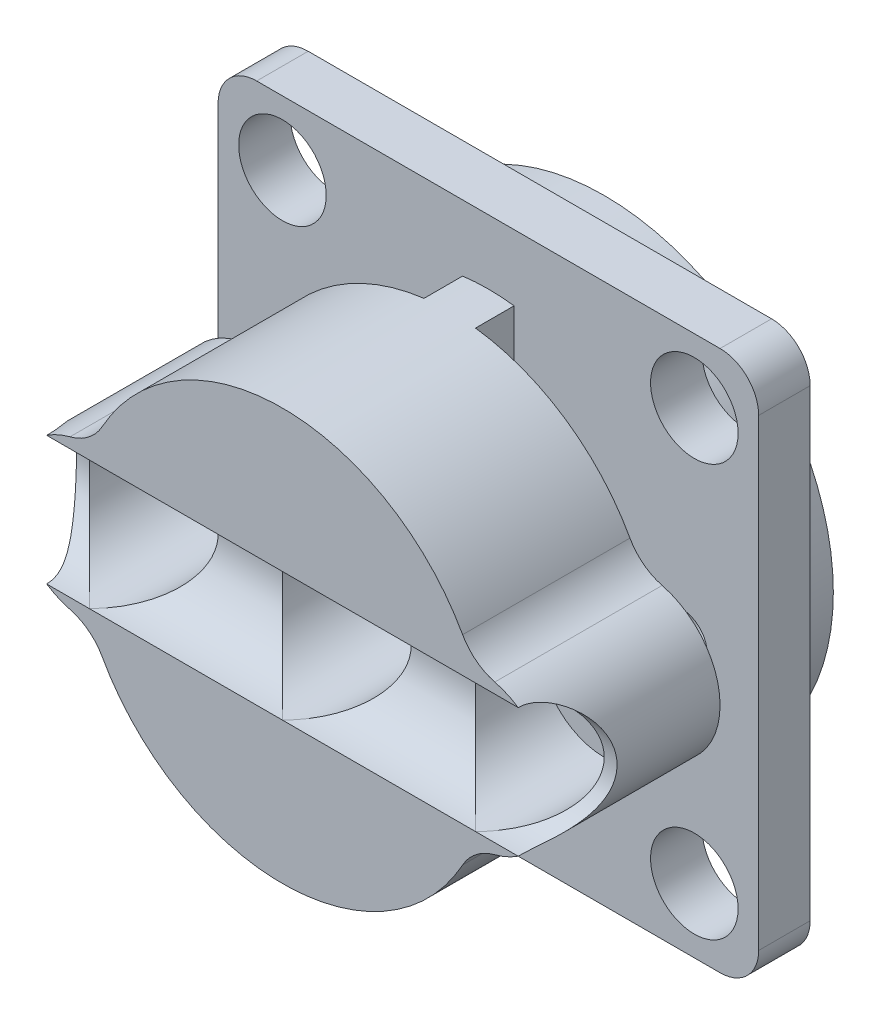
ISO-10303-21;
HEADER;
FILE_DESCRIPTION(('STEP AP214'),'2;1');
FILE_NAME('part.step','',(''),(''),'','','');
FILE_SCHEMA(('AUTOMOTIVE_DESIGN { 1 0 10303 214 1 1 1 1 }'));
ENDSEC;
DATA;
#1=APPLICATION_CONTEXT('core data for automotive mechanical design processes');
#2=APPLICATION_PROTOCOL_DEFINITION('international standard','automotive_design',2000,#1);
#3=PRODUCT_CONTEXT('',#1,'mechanical');
#4=PRODUCT('Part','Part','',(#3));
#5=PRODUCT_RELATED_PRODUCT_CATEGORY('part','',(#4));
#6=PRODUCT_DEFINITION_FORMATION('','',#4);
#7=PRODUCT_DEFINITION_CONTEXT('part definition',#1,'design');
#8=PRODUCT_DEFINITION('design','',#6,#7);
#9=PRODUCT_DEFINITION_SHAPE('','',#8);
#10=(LENGTH_UNIT() NAMED_UNIT(*) SI_UNIT(.MILLI.,.METRE.));
#11=(NAMED_UNIT(*) PLANE_ANGLE_UNIT() SI_UNIT($,.RADIAN.));
#12=(NAMED_UNIT(*) SI_UNIT($,.STERADIAN.) SOLID_ANGLE_UNIT());
#13=UNCERTAINTY_MEASURE_WITH_UNIT(LENGTH_MEASURE(1.E-05),#10,'distance_accuracy_value','');
#14=(GEOMETRIC_REPRESENTATION_CONTEXT(3) GLOBAL_UNCERTAINTY_ASSIGNED_CONTEXT((#13)) GLOBAL_UNIT_ASSIGNED_CONTEXT((#10,
#11,#12)) REPRESENTATION_CONTEXT('',''));
#15=CARTESIAN_POINT('',(0.,0.,0.));
#16=DIRECTION('',(0.,0.,1.));
#17=DIRECTION('',(1.,0.,0.));
#18=AXIS2_PLACEMENT_3D('',#15,#16,#17);
#19=CARTESIAN_POINT('',(-10.5,10.5,-2.5));
#20=DIRECTION('',(0.,0.,-1.));
#21=DIRECTION('',(-1.,0.,0.));
#22=AXIS2_PLACEMENT_3D('',#19,#20,#21);
#23=PLANE('',#22);
#24=CARTESIAN_POINT('',(-10.5,10.5,-2.5));
#25=DIRECTION('',(0.,0.,-1.));
#26=DIRECTION('',(-1.,0.,0.));
#27=AXIS2_PLACEMENT_3D('',#24,#25,#26);
#28=CIRCLE('',#27,8.9);
#29=CARTESIAN_POINT('',(-19.4,10.5,-2.5));
#30=VERTEX_POINT('',#29);
#31=EDGE_CURVE('E503',#30,#30,#28,.T.);
#32=ORIENTED_EDGE('',*,*,#31,.T.);
#33=EDGE_LOOP('',(#32));
#34=FACE_BOUND('',#33,.T.);
#35=CARTESIAN_POINT('',(-10.5,10.5,-2.5));
#36=DIRECTION('',(0.,0.,-1.));
#37=DIRECTION('',(-1.,0.,0.));
#38=AXIS2_PLACEMENT_3D('',#35,#36,#37);
#39=CIRCLE('',#38,4.53080369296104);
#40=CARTESIAN_POINT('',(-15.030803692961,10.5,-2.5));
#41=VERTEX_POINT('',#40);
#42=EDGE_CURVE('E492',#41,#41,#39,.T.);
#43=ORIENTED_EDGE('',*,*,#42,.F.);
#44=EDGE_LOOP('',(#43));
#45=FACE_BOUND('',#44,.T.);
#46=CARTESIAN_POINT('',(-18.,10.5,-2.5));
#47=DIRECTION('',(0.,0.,-1.));
#48=DIRECTION('',(-1.,0.,0.));
#49=AXIS2_PLACEMENT_3D('',#46,#47,#48);
#50=CIRCLE('',#49,0.999999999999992);
#51=CARTESIAN_POINT('',(-19.,10.5,-2.5));
#52=VERTEX_POINT('',#51);
#53=EDGE_CURVE('E824',#52,#52,#50,.T.);
#54=ORIENTED_EDGE('',*,*,#53,.F.);
#55=EDGE_LOOP('',(#54));
#56=FACE_BOUND('',#55,.T.);
#57=CARTESIAN_POINT('',(-3.,10.5,-2.5));
#58=DIRECTION('',(0.,0.,1.));
#59=DIRECTION('',(1.,0.,0.));
#60=AXIS2_PLACEMENT_3D('',#57,#58,#59);
#61=CIRCLE('',#60,0.999999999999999);
#62=CARTESIAN_POINT('',(-2.,10.5,-2.5));
#63=VERTEX_POINT('',#62);
#64=EDGE_CURVE('E817',#63,#63,#61,.T.);
#65=ORIENTED_EDGE('',*,*,#64,.T.);
#66=EDGE_LOOP('',(#65));
#67=FACE_BOUND('',#66,.T.);
#68=ADVANCED_FACE('F26',(#34,#45,#56,#67),#23,.T.);
#69=CARTESIAN_POINT('',(0.,10.5,10.));
#70=DIRECTION('',(-1.,0.,0.));
#71=DIRECTION('',(0.,-1.,0.));
#72=AXIS2_PLACEMENT_3D('',#69,#70,#71);
#73=CYLINDRICAL_SURFACE('',#72,2.5);
#74=DIRECTION('',(-1.,0.,0.));
#75=VECTOR('',#74,1.);
#76=CARTESIAN_POINT('',(0.,8.,10.));
#77=LINE('',#76,#75);
#78=CARTESIAN_POINT('',(-10.5,8.,10.));
#79=VERTEX_POINT('',#78);
#80=CARTESIAN_POINT('',(-3.,8.,10.));
#81=VERTEX_POINT('',#80);
#82=EDGE_CURVE('E48',#79,#81,#77,.F.);
#83=ORIENTED_EDGE('',*,*,#82,.T.);
#84=CARTESIAN_POINT('',(-3.,10.5,10.));
#85=DIRECTION('',(-0.707106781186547,0.,0.707106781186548));
#86=DIRECTION('',(-0.707106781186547,0.,-0.707106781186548));
#87=AXIS2_PLACEMENT_3D('',#84,#85,#86);
#88=ELLIPSE('',#87,3.53553390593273,2.5);
#89=CARTESIAN_POINT('',(-3.,13.,10.));
#90=VERTEX_POINT('',#89);
#91=EDGE_CURVE('E40',#81,#90,#88,.F.);
#92=ORIENTED_EDGE('',*,*,#91,.T.);
#93=DIRECTION('',(-1.,0.,0.));
#94=VECTOR('',#93,1.);
#95=CARTESIAN_POINT('',(0.,13.,10.));
#96=LINE('',#95,#94);
#97=CARTESIAN_POINT('',(-10.5,13.,10.));
#98=VERTEX_POINT('',#97);
#99=EDGE_CURVE('E226',#90,#98,#96,.T.);
#100=ORIENTED_EDGE('',*,*,#99,.T.);
#101=CARTESIAN_POINT('',(-10.5,10.5,10.));
#102=DIRECTION('',(-0.707106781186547,0.,-0.707106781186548));
#103=DIRECTION('',(0.707106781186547,0.,-0.707106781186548));
#104=AXIS2_PLACEMENT_3D('',#101,#102,#103);
#105=ELLIPSE('',#104,3.53553390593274,2.5);
#106=EDGE_CURVE('E256',#79,#98,#105,.F.);
#107=ORIENTED_EDGE('',*,*,#106,.F.);
#108=EDGE_LOOP('',(#83,#92,#100,#107));
#109=FACE_BOUND('',#108,.T.);
#110=ADVANCED_FACE('F224',(#109),#73,.F.);
#111=CARTESIAN_POINT('',(-10.5,10.5,10.));
#112=DIRECTION('',(0.,0.,1.));
#113=DIRECTION('',(1.,0.,0.));
#114=AXIS2_PLACEMENT_3D('',#111,#112,#113);
#115=PLANE('',#114);
#116=CARTESIAN_POINT('',(-1.3416876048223,13.,10.));
#117=VERTEX_POINT('',#116);
#118=EDGE_CURVE('E234',#117,#90,#96,.T.);
#119=ORIENTED_EDGE('',*,*,#118,.F.);
#120=CARTESIAN_POINT('',(-3.,10.5,10.));
#121=DIRECTION('',(0.,0.,1.));
#122=DIRECTION('',(1.,0.,0.));
#123=AXIS2_PLACEMENT_3D('',#120,#121,#122);
#124=CIRCLE('',#123,3.);
#125=CARTESIAN_POINT('',(-2.25,13.4047375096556,10.));
#126=VERTEX_POINT('',#125);
#127=EDGE_CURVE('E617',#117,#126,#124,.T.);
#128=ORIENTED_EDGE('',*,*,#127,.T.);
#129=CARTESIAN_POINT('',(-1.75,15.3412291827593,10.));
#130=DIRECTION('',(0.,0.,1.));
#131=DIRECTION('',(1.,0.,0.));
#132=AXIS2_PLACEMENT_3D('',#129,#130,#131);
#133=CIRCLE('',#132,2.);
#134=CARTESIAN_POINT('',(-3.5,14.3729833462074,10.));
#135=VERTEX_POINT('',#134);
#136=EDGE_CURVE('E457',#126,#135,#133,.F.);
#137=ORIENTED_EDGE('',*,*,#136,.T.);
#138=CARTESIAN_POINT('',(-10.5,10.5,10.));
#139=DIRECTION('',(0.,0.,1.));
#140=DIRECTION('',(1.,0.,0.));
#141=AXIS2_PLACEMENT_3D('',#138,#139,#140);
#142=CIRCLE('',#141,8.);
#143=CARTESIAN_POINT('',(-17.5,14.3729833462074,10.));
#144=VERTEX_POINT('',#143);
#145=EDGE_CURVE('E533',#135,#144,#142,.T.);
#146=ORIENTED_EDGE('',*,*,#145,.T.);
#147=CARTESIAN_POINT('',(-19.25,15.3412291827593,10.));
#148=DIRECTION('',(0.,0.,1.));
#149=DIRECTION('',(1.,0.,0.));
#150=AXIS2_PLACEMENT_3D('',#147,#148,#149);
#151=CIRCLE('',#150,2.);
#152=CARTESIAN_POINT('',(-18.75,13.4047375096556,10.));
#153=VERTEX_POINT('',#152);
#154=EDGE_CURVE('E455',#144,#153,#151,.F.);
#155=ORIENTED_EDGE('',*,*,#154,.T.);
#156=CARTESIAN_POINT('',(-18.,10.5,10.));
#157=DIRECTION('',(0.,0.,1.));
#158=DIRECTION('',(1.,0.,0.));
#159=AXIS2_PLACEMENT_3D('',#156,#157,#158);
#160=CIRCLE('',#159,3.);
#161=CARTESIAN_POINT('',(-19.6583123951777,13.,10.));
#162=VERTEX_POINT('',#161);
#163=EDGE_CURVE('E484',#153,#162,#160,.T.);
#164=ORIENTED_EDGE('',*,*,#163,.T.);
#165=CARTESIAN_POINT('',(-18.,13.,10.));
#166=VERTEX_POINT('',#165);
#167=EDGE_CURVE('E242',#166,#162,#96,.T.);
#168=ORIENTED_EDGE('',*,*,#167,.F.);
#169=EDGE_CURVE('E238',#98,#166,#96,.T.);
#170=ORIENTED_EDGE('',*,*,#169,.F.);
#171=ORIENTED_EDGE('',*,*,#99,.F.);
#172=EDGE_LOOP('',(#119,#128,#137,#146,#155,#164,#168,#170,#171));
#173=FACE_BOUND('',#172,.T.);
#174=ADVANCED_FACE('F233',(#173),#115,.T.);
#175=CARTESIAN_POINT('',(-21.,0.,2.));
#176=DIRECTION('',(0.,0.,1.));
#177=DIRECTION('',(1.,0.,0.));
#178=AXIS2_PLACEMENT_3D('',#175,#176,#177);
#179=PLANE('',#178);
#180=CARTESIAN_POINT('',(-3.,10.5,2.));
#181=DIRECTION('',(0.,0.,1.));
#182=DIRECTION('',(1.,0.,0.));
#183=AXIS2_PLACEMENT_3D('',#180,#181,#182);
#184=CIRCLE('',#183,0.999999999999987);
#185=CARTESIAN_POINT('',(-2.00000000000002,10.5,2.));
#186=VERTEX_POINT('',#185);
#187=EDGE_CURVE('E820',#186,#186,#184,.T.);
#188=ORIENTED_EDGE('',*,*,#187,.F.);
#189=EDGE_LOOP('',(#188));
#190=FACE_BOUND('',#189,.T.);
#191=CARTESIAN_POINT('',(-18.,10.5,2.));
#192=DIRECTION('',(0.,0.,1.));
#193=DIRECTION('',(1.,0.,0.));
#194=AXIS2_PLACEMENT_3D('',#191,#192,#193);
#195=CIRCLE('',#194,0.999999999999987);
#196=CARTESIAN_POINT('',(-17.,10.5,2.));
#197=VERTEX_POINT('',#196);
#198=EDGE_CURVE('E821',#197,#197,#195,.T.);
#199=ORIENTED_EDGE('',*,*,#198,.F.);
#200=EDGE_LOOP('',(#199));
#201=FACE_BOUND('',#200,.T.);
#202=CARTESIAN_POINT('',(-10.5,10.5,2.));
#203=DIRECTION('',(0.,0.,1.));
#204=DIRECTION('',(1.,0.,0.));
#205=AXIS2_PLACEMENT_3D('',#202,#203,#204);
#206=CIRCLE('',#205,8.);
#207=CARTESIAN_POINT('',(-11.5,2.56274606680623,2.));
#208=VERTEX_POINT('',#207);
#209=CARTESIAN_POINT('',(-9.5,2.56274606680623,2.));
#210=VERTEX_POINT('',#209);
#211=EDGE_CURVE('E531',#208,#210,#206,.T.);
#212=ORIENTED_EDGE('',*,*,#211,.F.);
#213=DIRECTION('',(0.,1.,0.));
#214=VECTOR('',#213,1.);
#215=CARTESIAN_POINT('',(-11.5,0.,2.));
#216=LINE('',#215,#214);
#217=CARTESIAN_POINT('',(-11.5,8.20871215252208,2.));
#218=VERTEX_POINT('',#217);
#219=EDGE_CURVE('E667',#208,#218,#216,.T.);
#220=ORIENTED_EDGE('',*,*,#219,.T.);
#221=CARTESIAN_POINT('',(-10.5,10.5,2.));
#222=DIRECTION('',(0.,0.,-1.));
#223=DIRECTION('',(-1.,0.,0.));
#224=AXIS2_PLACEMENT_3D('',#221,#222,#223);
#225=CIRCLE('',#224,2.5);
#226=CARTESIAN_POINT('',(-11.5,12.7912878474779,2.));
#227=VERTEX_POINT('',#226);
#228=EDGE_CURVE('E659',#227,#218,#225,.F.);
#229=ORIENTED_EDGE('',*,*,#228,.F.);
#230=CARTESIAN_POINT('',(-11.5,18.4372539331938,2.));
#231=VERTEX_POINT('',#230);
#232=EDGE_CURVE('E664',#227,#231,#216,.T.);
#233=ORIENTED_EDGE('',*,*,#232,.T.);
#234=CARTESIAN_POINT('',(-9.5,18.4372539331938,2.));
#235=VERTEX_POINT('',#234);
#236=EDGE_CURVE('E530',#235,#231,#206,.T.);
#237=ORIENTED_EDGE('',*,*,#236,.F.);
#238=DIRECTION('',(0.,1.,0.));
#239=VECTOR('',#238,1.);
#240=CARTESIAN_POINT('',(-9.5,0.,2.));
#241=LINE('',#240,#239);
#242=CARTESIAN_POINT('',(-9.5,12.7912878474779,2.));
#243=VERTEX_POINT('',#242);
#244=EDGE_CURVE('E640',#243,#235,#241,.T.);
#245=ORIENTED_EDGE('',*,*,#244,.F.);
#246=CARTESIAN_POINT('',(-10.5,10.5,2.));
#247=DIRECTION('',(0.,0.,-1.));
#248=DIRECTION('',(-1.,0.,0.));
#249=AXIS2_PLACEMENT_3D('',#246,#247,#248);
#250=CIRCLE('',#249,2.5);
#251=CARTESIAN_POINT('',(-9.5,8.20871215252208,2.));
#252=VERTEX_POINT('',#251);
#253=EDGE_CURVE('E636',#252,#243,#250,.F.);
#254=ORIENTED_EDGE('',*,*,#253,.F.);
#255=EDGE_CURVE('E642',#210,#252,#241,.T.);
#256=ORIENTED_EDGE('',*,*,#255,.F.);
#257=EDGE_LOOP('',(#212,#220,#229,#233,#237,#245,#254,#256));
#258=FACE_BOUND('',#257,.T.);
#259=DIRECTION('',(1.,0.,0.));
#260=VECTOR('',#259,1.);
#261=CARTESIAN_POINT('',(-21.,0.,2.));
#262=LINE('',#261,#260);
#263=CARTESIAN_POINT('',(-19.5,0.,2.));
#264=VERTEX_POINT('',#263);
#265=CARTESIAN_POINT('',(-1.50000000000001,0.,2.));
#266=VERTEX_POINT('',#265);
#267=EDGE_CURVE('E377',#264,#266,#262,.T.);
#268=ORIENTED_EDGE('',*,*,#267,.T.);
#269=CARTESIAN_POINT('',(-1.5,1.5,2.));
#270=DIRECTION('',(0.,0.,1.));
#271=DIRECTION('',(1.,0.,0.));
#272=AXIS2_PLACEMENT_3D('',#269,#270,#271);
#273=CIRCLE('',#272,1.5);
#274=CARTESIAN_POINT('',(0.,1.50000000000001,2.));
#275=VERTEX_POINT('',#274);
#276=EDGE_CURVE('E413',#266,#275,#273,.T.);
#277=ORIENTED_EDGE('',*,*,#276,.T.);
#278=DIRECTION('',(0.,1.,0.));
#279=VECTOR('',#278,1.);
#280=CARTESIAN_POINT('',(0.,21.,2.));
#281=LINE('',#280,#279);
#282=CARTESIAN_POINT('',(0.,19.5,2.));
#283=VERTEX_POINT('',#282);
#284=EDGE_CURVE('E386',#275,#283,#281,.T.);
#285=ORIENTED_EDGE('',*,*,#284,.T.);
#286=CARTESIAN_POINT('',(-1.5,19.5,2.));
#287=DIRECTION('',(0.,0.,1.));
#288=DIRECTION('',(1.,0.,0.));
#289=AXIS2_PLACEMENT_3D('',#286,#287,#288);
#290=CIRCLE('',#289,1.5);
#291=CARTESIAN_POINT('',(-1.5,21.,2.));
#292=VERTEX_POINT('',#291);
#293=EDGE_CURVE('E411',#283,#292,#290,.T.);
#294=ORIENTED_EDGE('',*,*,#293,.T.);
#295=DIRECTION('',(-1.,0.,0.));
#296=VECTOR('',#295,1.);
#297=CARTESIAN_POINT('',(-21.,21.,2.));
#298=LINE('',#297,#296);
#299=CARTESIAN_POINT('',(-19.5,21.,2.));
#300=VERTEX_POINT('',#299);
#301=EDGE_CURVE('E397',#292,#300,#298,.T.);
#302=ORIENTED_EDGE('',*,*,#301,.T.);
#303=CARTESIAN_POINT('',(-19.5,19.5,2.));
#304=DIRECTION('',(0.,0.,1.));
#305=DIRECTION('',(1.,0.,0.));
#306=AXIS2_PLACEMENT_3D('',#303,#304,#305);
#307=CIRCLE('',#306,1.5);
#308=CARTESIAN_POINT('',(-21.,19.5,2.));
#309=VERTEX_POINT('',#308);
#310=EDGE_CURVE('E415',#300,#309,#307,.T.);
#311=ORIENTED_EDGE('',*,*,#310,.T.);
#312=DIRECTION('',(0.,-1.,0.));
#313=VECTOR('',#312,1.);
#314=CARTESIAN_POINT('',(-21.,21.,2.));
#315=LINE('',#314,#313);
#316=CARTESIAN_POINT('',(-21.,1.50000000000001,2.));
#317=VERTEX_POINT('',#316);
#318=EDGE_CURVE('E387',#309,#317,#315,.T.);
#319=ORIENTED_EDGE('',*,*,#318,.T.);
#320=CARTESIAN_POINT('',(-19.5,1.5,2.));
#321=DIRECTION('',(0.,0.,1.));
#322=DIRECTION('',(1.,0.,0.));
#323=AXIS2_PLACEMENT_3D('',#320,#321,#322);
#324=CIRCLE('',#323,1.5);
#325=EDGE_CURVE('E391',#317,#264,#324,.T.);
#326=ORIENTED_EDGE('',*,*,#325,.T.);
#327=EDGE_LOOP('',(#268,#277,#285,#294,#302,#311,#319,#326));
#328=FACE_BOUND('',#327,.T.);
#329=CARTESIAN_POINT('',(-2.5,18.5,2.));
#330=DIRECTION('',(0.,0.,1.));
#331=DIRECTION('',(1.,0.,0.));
#332=AXIS2_PLACEMENT_3D('',#329,#330,#331);
#333=CIRCLE('',#332,1.69999999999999);
#334=CARTESIAN_POINT('',(-0.800000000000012,18.5,2.));
#335=VERTEX_POINT('',#334);
#336=EDGE_CURVE('E524',#335,#335,#333,.T.);
#337=ORIENTED_EDGE('',*,*,#336,.F.);
#338=EDGE_LOOP('',(#337));
#339=FACE_BOUND('',#338,.T.);
#340=CARTESIAN_POINT('',(-2.5,2.5,2.));
#341=DIRECTION('',(0.,0.,1.));
#342=DIRECTION('',(1.,0.,0.));
#343=AXIS2_PLACEMENT_3D('',#340,#341,#342);
#344=CIRCLE('',#343,1.69999999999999);
#345=CARTESIAN_POINT('',(-0.800000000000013,2.5,2.));
#346=VERTEX_POINT('',#345);
#347=EDGE_CURVE('E512',#346,#346,#344,.T.);
#348=ORIENTED_EDGE('',*,*,#347,.F.);
#349=EDGE_LOOP('',(#348));
#350=FACE_BOUND('',#349,.T.);
#351=CARTESIAN_POINT('',(-18.5,18.5,2.));
#352=DIRECTION('',(0.,0.,1.));
#353=DIRECTION('',(1.,0.,0.));
#354=AXIS2_PLACEMENT_3D('',#351,#352,#353);
#355=CIRCLE('',#354,1.69999999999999);
#356=CARTESIAN_POINT('',(-16.8,18.5,2.));
#357=VERTEX_POINT('',#356);
#358=EDGE_CURVE('E518',#357,#357,#355,.T.);
#359=ORIENTED_EDGE('',*,*,#358,.F.);
#360=EDGE_LOOP('',(#359));
#361=FACE_BOUND('',#360,.T.);
#362=CARTESIAN_POINT('',(-18.5,2.5,2.));
#363=DIRECTION('',(0.,0.,1.));
#364=DIRECTION('',(1.,0.,0.));
#365=AXIS2_PLACEMENT_3D('',#362,#363,#364);
#366=CIRCLE('',#365,1.69999999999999);
#367=CARTESIAN_POINT('',(-16.8,2.5,2.));
#368=VERTEX_POINT('',#367);
#369=EDGE_CURVE('E506',#368,#368,#366,.T.);
#370=ORIENTED_EDGE('',*,*,#369,.F.);
#371=EDGE_LOOP('',(#370));
#372=FACE_BOUND('',#371,.T.);
#373=ADVANCED_FACE('F352',(#190,#201,#258,#328,#339,#350,#361,#372),#179,.T.);
#374=CARTESIAN_POINT('',(-10.5,10.5,10.));
#375=DIRECTION('',(0.,0.,-1.));
#376=DIRECTION('',(-1.,0.,0.));
#377=AXIS2_PLACEMENT_3D('',#374,#375,#376);
#378=CYLINDRICAL_SURFACE('',#377,8.);
#379=CARTESIAN_POINT('',(-10.5,10.5,3.5));
#380=DIRECTION('',(0.,0.,1.));
#381=DIRECTION('',(1.,0.,0.));
#382=AXIS2_PLACEMENT_3D('',#379,#380,#381);
#383=CIRCLE('',#382,8.);
#384=CARTESIAN_POINT('',(-17.5,6.62701665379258,3.5));
#385=VERTEX_POINT('',#384);
#386=CARTESIAN_POINT('',(-11.5,2.56274606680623,3.5));
#387=VERTEX_POINT('',#386);
#388=EDGE_CURVE('E602',#385,#387,#383,.T.);
#389=ORIENTED_EDGE('',*,*,#388,.T.);
#390=DIRECTION('',(0.,0.,-1.));
#391=VECTOR('',#390,1.);
#392=CARTESIAN_POINT('',(-11.5,2.56274606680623,10.));
#393=LINE('',#392,#391);
#394=EDGE_CURVE('E643',#387,#208,#393,.T.);
#395=ORIENTED_EDGE('',*,*,#394,.T.);
#396=ORIENTED_EDGE('',*,*,#211,.T.);
#397=DIRECTION('',(0.,0.,-1.));
#398=VECTOR('',#397,1.);
#399=CARTESIAN_POINT('',(-9.5,2.56274606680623,10.));
#400=LINE('',#399,#398);
#401=CARTESIAN_POINT('',(-9.5,2.56274606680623,3.5));
#402=VERTEX_POINT('',#401);
#403=EDGE_CURVE('E618',#210,#402,#400,.F.);
#404=ORIENTED_EDGE('',*,*,#403,.T.);
#405=CARTESIAN_POINT('',(-10.5,10.5,3.5));
#406=DIRECTION('',(0.,0.,1.));
#407=DIRECTION('',(1.,0.,0.));
#408=AXIS2_PLACEMENT_3D('',#405,#406,#407);
#409=CIRCLE('',#408,8.);
#410=CARTESIAN_POINT('',(-3.49999999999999,6.62701665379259,3.5));
#411=VERTEX_POINT('',#410);
#412=EDGE_CURVE('E613',#402,#411,#409,.T.);
#413=ORIENTED_EDGE('',*,*,#412,.T.);
#414=DIRECTION('',(0.,0.,-1.));
#415=VECTOR('',#414,1.);
#416=CARTESIAN_POINT('',(-3.49999999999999,6.62701665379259,10.));
#417=LINE('',#416,#415);
#418=CARTESIAN_POINT('',(-3.5,6.62701665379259,10.));
#419=VERTEX_POINT('',#418);
#420=EDGE_CURVE('E453',#411,#419,#417,.F.);
#421=ORIENTED_EDGE('',*,*,#420,.T.);
#422=CARTESIAN_POINT('',(-17.5,6.62701665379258,10.));
#423=VERTEX_POINT('',#422);
#424=EDGE_CURVE('E534',#423,#419,#142,.T.);
#425=ORIENTED_EDGE('',*,*,#424,.F.);
#426=DIRECTION('',(0.,0.,-1.));
#427=VECTOR('',#426,1.);
#428=CARTESIAN_POINT('',(-17.5,6.62701665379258,10.));
#429=LINE('',#428,#427);
#430=EDGE_CURVE('E450',#423,#385,#429,.T.);
#431=ORIENTED_EDGE('',*,*,#430,.T.);
#432=EDGE_LOOP('',(#389,#395,#396,#404,#413,#421,#425,#431));
#433=FACE_BOUND('',#432,.T.);
#434=ADVANCED_FACE('F348',(#433),#378,.T.);
#435=ORIENTED_EDGE('',*,*,#236,.T.);
#436=DIRECTION('',(0.,0.,-1.));
#437=VECTOR('',#436,1.);
#438=CARTESIAN_POINT('',(-11.5,18.4372539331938,10.));
#439=LINE('',#438,#437);
#440=CARTESIAN_POINT('',(-11.5,18.4372539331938,3.5));
#441=VERTEX_POINT('',#440);
#442=EDGE_CURVE('E649',#231,#441,#439,.F.);
#443=ORIENTED_EDGE('',*,*,#442,.T.);
#444=CARTESIAN_POINT('',(-10.5,10.5,3.5));
#445=DIRECTION('',(0.,0.,1.));
#446=DIRECTION('',(1.,0.,0.));
#447=AXIS2_PLACEMENT_3D('',#444,#445,#446);
#448=CIRCLE('',#447,8.);
#449=CARTESIAN_POINT('',(-17.5,14.3729833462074,3.5));
#450=VERTEX_POINT('',#449);
#451=EDGE_CURVE('E655',#441,#450,#448,.T.);
#452=ORIENTED_EDGE('',*,*,#451,.T.);
#453=DIRECTION('',(0.,0.,-1.));
#454=VECTOR('',#453,1.);
#455=CARTESIAN_POINT('',(-17.5,14.3729833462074,10.));
#456=LINE('',#455,#454);
#457=EDGE_CURVE('E442',#450,#144,#456,.F.);
#458=ORIENTED_EDGE('',*,*,#457,.T.);
#459=ORIENTED_EDGE('',*,*,#145,.F.);
#460=DIRECTION('',(0.,0.,-1.));
#461=VECTOR('',#460,1.);
#462=CARTESIAN_POINT('',(-3.5,14.3729833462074,10.));
#463=LINE('',#462,#461);
#464=CARTESIAN_POINT('',(-3.5,14.3729833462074,3.5));
#465=VERTEX_POINT('',#464);
#466=EDGE_CURVE('E439',#135,#465,#463,.T.);
#467=ORIENTED_EDGE('',*,*,#466,.T.);
#468=CARTESIAN_POINT('',(-10.5,10.5,3.5));
#469=DIRECTION('',(0.,0.,1.));
#470=DIRECTION('',(1.,0.,0.));
#471=AXIS2_PLACEMENT_3D('',#468,#469,#470);
#472=CIRCLE('',#471,8.);
#473=CARTESIAN_POINT('',(-9.5,18.4372539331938,3.5));
#474=VERTEX_POINT('',#473);
#475=EDGE_CURVE('E627',#465,#474,#472,.T.);
#476=ORIENTED_EDGE('',*,*,#475,.T.);
#477=DIRECTION('',(0.,0.,-1.));
#478=VECTOR('',#477,1.);
#479=CARTESIAN_POINT('',(-9.5,18.4372539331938,10.));
#480=LINE('',#479,#478);
#481=EDGE_CURVE('E619',#474,#235,#480,.T.);
#482=ORIENTED_EDGE('',*,*,#481,.T.);
#483=EDGE_LOOP('',(#435,#443,#452,#458,#459,#467,#476,#482));
#484=FACE_BOUND('',#483,.T.);
#485=ADVANCED_FACE('F351',(#484),#378,.T.);
#486=CARTESIAN_POINT('',(-21.,0.,0.));
#487=DIRECTION('',(0.,0.,1.));
#488=DIRECTION('',(1.,0.,0.));
#489=AXIS2_PLACEMENT_3D('',#486,#487,#488);
#490=PLANE('',#489);
#491=DIRECTION('',(1.,0.,0.));
#492=VECTOR('',#491,1.);
#493=CARTESIAN_POINT('',(-21.,0.,0.));
#494=LINE('',#493,#492);
#495=CARTESIAN_POINT('',(-19.5,0.,0.));
#496=VERTEX_POINT('',#495);
#497=CARTESIAN_POINT('',(-1.50000000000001,0.,0.));
#498=VERTEX_POINT('',#497);
#499=EDGE_CURVE('E540',#496,#498,#494,.T.);
#500=ORIENTED_EDGE('',*,*,#499,.F.);
#501=CARTESIAN_POINT('',(-19.5,1.5,0.));
#502=DIRECTION('',(0.,0.,1.));
#503=DIRECTION('',(1.,0.,0.));
#504=AXIS2_PLACEMENT_3D('',#501,#502,#503);
#505=CIRCLE('',#504,1.5);
#506=CARTESIAN_POINT('',(-21.,1.50000000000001,0.));
#507=VERTEX_POINT('',#506);
#508=EDGE_CURVE('E392',#496,#507,#505,.F.);
#509=ORIENTED_EDGE('',*,*,#508,.T.);
#510=DIRECTION('',(0.,-1.,0.));
#511=VECTOR('',#510,1.);
#512=CARTESIAN_POINT('',(-21.,21.,0.));
#513=LINE('',#512,#511);
#514=CARTESIAN_POINT('',(-21.,19.5,0.));
#515=VERTEX_POINT('',#514);
#516=EDGE_CURVE('E537',#515,#507,#513,.T.);
#517=ORIENTED_EDGE('',*,*,#516,.F.);
#518=CARTESIAN_POINT('',(-19.5,19.5,0.));
#519=DIRECTION('',(0.,0.,1.));
#520=DIRECTION('',(1.,0.,0.));
#521=AXIS2_PLACEMENT_3D('',#518,#519,#520);
#522=CIRCLE('',#521,1.5);
#523=CARTESIAN_POINT('',(-19.5,21.,0.));
#524=VERTEX_POINT('',#523);
#525=EDGE_CURVE('E402',#515,#524,#522,.F.);
#526=ORIENTED_EDGE('',*,*,#525,.T.);
#527=DIRECTION('',(-1.,0.,0.));
#528=VECTOR('',#527,1.);
#529=CARTESIAN_POINT('',(-21.,21.,0.));
#530=LINE('',#529,#528);
#531=CARTESIAN_POINT('',(-1.5,21.,0.));
#532=VERTEX_POINT('',#531);
#533=EDGE_CURVE('E545',#532,#524,#530,.T.);
#534=ORIENTED_EDGE('',*,*,#533,.F.);
#535=CARTESIAN_POINT('',(-1.5,19.5,0.));
#536=DIRECTION('',(0.,0.,1.));
#537=DIRECTION('',(1.,0.,0.));
#538=AXIS2_PLACEMENT_3D('',#535,#536,#537);
#539=CIRCLE('',#538,1.5);
#540=CARTESIAN_POINT('',(0.,19.5,0.));
#541=VERTEX_POINT('',#540);
#542=EDGE_CURVE('E393',#532,#541,#539,.F.);
#543=ORIENTED_EDGE('',*,*,#542,.T.);
#544=DIRECTION('',(0.,1.,0.));
#545=VECTOR('',#544,1.);
#546=CARTESIAN_POINT('',(0.,21.,0.));
#547=LINE('',#546,#545);
#548=CARTESIAN_POINT('',(0.,1.50000000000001,0.));
#549=VERTEX_POINT('',#548);
#550=EDGE_CURVE('E542',#549,#541,#547,.T.);
#551=ORIENTED_EDGE('',*,*,#550,.F.);
#552=CARTESIAN_POINT('',(-1.5,1.5,0.));
#553=DIRECTION('',(0.,0.,1.));
#554=DIRECTION('',(1.,0.,0.));
#555=AXIS2_PLACEMENT_3D('',#552,#553,#554);
#556=CIRCLE('',#555,1.5);
#557=EDGE_CURVE('E395',#549,#498,#556,.F.);
#558=ORIENTED_EDGE('',*,*,#557,.T.);
#559=EDGE_LOOP('',(#500,#509,#517,#526,#534,#543,#551,#558));
#560=FACE_BOUND('',#559,.T.);
#561=CARTESIAN_POINT('',(-2.5,18.5,0.));
#562=DIRECTION('',(0.,0.,1.));
#563=DIRECTION('',(1.,0.,0.));
#564=AXIS2_PLACEMENT_3D('',#561,#562,#563);
#565=CIRCLE('',#564,1.7);
#566=CARTESIAN_POINT('',(-0.800000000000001,18.5,0.));
#567=VERTEX_POINT('',#566);
#568=EDGE_CURVE('E527',#567,#567,#565,.T.);
#569=ORIENTED_EDGE('',*,*,#568,.T.);
#570=EDGE_LOOP('',(#569));
#571=FACE_BOUND('',#570,.T.);
#572=CARTESIAN_POINT('',(-18.5,18.5,0.));
#573=DIRECTION('',(0.,0.,1.));
#574=DIRECTION('',(1.,0.,0.));
#575=AXIS2_PLACEMENT_3D('',#572,#573,#574);
#576=CIRCLE('',#575,1.7);
#577=CARTESIAN_POINT('',(-16.8,18.5,0.));
#578=VERTEX_POINT('',#577);
#579=EDGE_CURVE('E521',#578,#578,#576,.T.);
#580=ORIENTED_EDGE('',*,*,#579,.T.);
#581=EDGE_LOOP('',(#580));
#582=FACE_BOUND('',#581,.T.);
#583=CARTESIAN_POINT('',(-2.5,2.5,0.));
#584=DIRECTION('',(0.,0.,1.));
#585=DIRECTION('',(1.,0.,0.));
#586=AXIS2_PLACEMENT_3D('',#583,#584,#585);
#587=CIRCLE('',#586,1.7);
#588=CARTESIAN_POINT('',(-0.800000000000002,2.5,0.));
#589=VERTEX_POINT('',#588);
#590=EDGE_CURVE('E515',#589,#589,#587,.T.);
#591=ORIENTED_EDGE('',*,*,#590,.T.);
#592=EDGE_LOOP('',(#591));
#593=FACE_BOUND('',#592,.T.);
#594=CARTESIAN_POINT('',(-18.5,2.5,0.));
#595=DIRECTION('',(0.,0.,1.));
#596=DIRECTION('',(1.,0.,0.));
#597=AXIS2_PLACEMENT_3D('',#594,#595,#596);
#598=CIRCLE('',#597,1.7);
#599=CARTESIAN_POINT('',(-16.8,2.5,0.));
#600=VERTEX_POINT('',#599);
#601=EDGE_CURVE('E509',#600,#600,#598,.T.);
#602=ORIENTED_EDGE('',*,*,#601,.T.);
#603=EDGE_LOOP('',(#602));
#604=FACE_BOUND('',#603,.T.);
#605=CARTESIAN_POINT('',(-10.5,10.5,0.));
#606=DIRECTION('',(0.,0.,1.));
#607=DIRECTION('',(1.,0.,0.));
#608=AXIS2_PLACEMENT_3D('',#605,#606,#607);
#609=CIRCLE('',#608,8.9);
#610=CARTESIAN_POINT('',(-1.6,10.5,0.));
#611=VERTEX_POINT('',#610);
#612=EDGE_CURVE('E430',#611,#611,#609,.F.);
#613=ORIENTED_EDGE('',*,*,#612,.F.);
#614=EDGE_LOOP('',(#613));
#615=FACE_BOUND('',#614,.T.);
#616=ADVANCED_FACE('F354',(#560,#571,#582,#593,#604,#615),#490,.F.);
#617=CARTESIAN_POINT('',(-21.,21.,2.));
#618=DIRECTION('',(1.,0.,0.));
#619=DIRECTION('',(0.,1.,0.));
#620=AXIS2_PLACEMENT_3D('',#617,#618,#619);
#621=PLANE('',#620);
#622=ORIENTED_EDGE('',*,*,#516,.T.);
#623=DIRECTION('',(0.,0.,-1.));
#624=VECTOR('',#623,1.);
#625=CARTESIAN_POINT('',(-21.,1.5,2.));
#626=LINE('',#625,#624);
#627=EDGE_CURVE('E408',#507,#317,#626,.F.);
#628=ORIENTED_EDGE('',*,*,#627,.T.);
#629=ORIENTED_EDGE('',*,*,#318,.F.);
#630=DIRECTION('',(0.,0.,-1.));
#631=VECTOR('',#630,1.);
#632=CARTESIAN_POINT('',(-21.,19.5,2.));
#633=LINE('',#632,#631);
#634=EDGE_CURVE('E405',#309,#515,#633,.T.);
#635=ORIENTED_EDGE('',*,*,#634,.T.);
#636=EDGE_LOOP('',(#622,#628,#629,#635));
#637=FACE_BOUND('',#636,.T.);
#638=ADVANCED_FACE('F28',(#637),#621,.F.);
#639=CARTESIAN_POINT('',(-21.,0.,2.));
#640=DIRECTION('',(0.,1.,0.));
#641=DIRECTION('',(0.,0.,1.));
#642=AXIS2_PLACEMENT_3D('',#639,#640,#641);
#643=PLANE('',#642);
#644=ORIENTED_EDGE('',*,*,#267,.F.);
#645=DIRECTION('',(0.,0.,-1.));
#646=VECTOR('',#645,1.);
#647=CARTESIAN_POINT('',(-19.5,0.,2.));
#648=LINE('',#647,#646);
#649=EDGE_CURVE('E380',#264,#496,#648,.T.);
#650=ORIENTED_EDGE('',*,*,#649,.T.);
#651=ORIENTED_EDGE('',*,*,#499,.T.);
#652=DIRECTION('',(0.,0.,-1.));
#653=VECTOR('',#652,1.);
#654=CARTESIAN_POINT('',(-1.5,0.,2.));
#655=LINE('',#654,#653);
#656=EDGE_CURVE('E383',#498,#266,#655,.F.);
#657=ORIENTED_EDGE('',*,*,#656,.T.);
#658=EDGE_LOOP('',(#644,#650,#651,#657));
#659=FACE_BOUND('',#658,.T.);
#660=ADVANCED_FACE('F366',(#659),#643,.F.);
#661=CARTESIAN_POINT('',(0.,21.,2.));
#662=DIRECTION('',(-1.,0.,0.));
#663=DIRECTION('',(0.,-1.,0.));
#664=AXIS2_PLACEMENT_3D('',#661,#662,#663);
#665=PLANE('',#664);
#666=ORIENTED_EDGE('',*,*,#284,.F.);
#667=DIRECTION('',(0.,0.,-1.));
#668=VECTOR('',#667,1.);
#669=CARTESIAN_POINT('',(0.,1.5,2.));
#670=LINE('',#669,#668);
#671=EDGE_CURVE('E427',#275,#549,#670,.T.);
#672=ORIENTED_EDGE('',*,*,#671,.T.);
#673=ORIENTED_EDGE('',*,*,#550,.T.);
#674=DIRECTION('',(0.,0.,-1.));
#675=VECTOR('',#674,1.);
#676=CARTESIAN_POINT('',(0.,19.5,2.));
#677=LINE('',#676,#675);
#678=EDGE_CURVE('E424',#541,#283,#677,.F.);
#679=ORIENTED_EDGE('',*,*,#678,.T.);
#680=EDGE_LOOP('',(#666,#672,#673,#679));
#681=FACE_BOUND('',#680,.T.);
#682=ADVANCED_FACE('F363',(#681),#665,.F.);
#683=CARTESIAN_POINT('',(-21.,21.,2.));
#684=DIRECTION('',(0.,-1.,0.));
#685=DIRECTION('',(0.,0.,-1.));
#686=AXIS2_PLACEMENT_3D('',#683,#684,#685);
#687=PLANE('',#686);
#688=ORIENTED_EDGE('',*,*,#533,.T.);
#689=DIRECTION('',(0.,0.,-1.));
#690=VECTOR('',#689,1.);
#691=CARTESIAN_POINT('',(-19.5,21.,2.));
#692=LINE('',#691,#690);
#693=EDGE_CURVE('E421',#524,#300,#692,.F.);
#694=ORIENTED_EDGE('',*,*,#693,.T.);
#695=ORIENTED_EDGE('',*,*,#301,.F.);
#696=DIRECTION('',(0.,0.,-1.));
#697=VECTOR('',#696,1.);
#698=CARTESIAN_POINT('',(-1.5,21.,2.));
#699=LINE('',#698,#697);
#700=EDGE_CURVE('E418',#292,#532,#699,.T.);
#701=ORIENTED_EDGE('',*,*,#700,.T.);
#702=EDGE_LOOP('',(#688,#694,#695,#701));
#703=FACE_BOUND('',#702,.T.);
#704=ADVANCED_FACE('F347',(#703),#687,.F.);
#705=CARTESIAN_POINT('',(-19.6583123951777,8.,10.));
#706=VERTEX_POINT('',#705);
#707=CARTESIAN_POINT('',(-18.,8.,10.));
#708=VERTEX_POINT('',#707);
#709=EDGE_CURVE('E257',#706,#708,#77,.F.);
#710=ORIENTED_EDGE('',*,*,#709,.F.);
#711=CARTESIAN_POINT('',(-18.75,7.59526249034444,10.));
#712=VERTEX_POINT('',#711);
#713=EDGE_CURVE('E489',#706,#712,#160,.T.);
#714=ORIENTED_EDGE('',*,*,#713,.T.);
#715=CARTESIAN_POINT('',(-19.25,5.65877081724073,10.));
#716=DIRECTION('',(0.,0.,1.));
#717=DIRECTION('',(1.,0.,0.));
#718=AXIS2_PLACEMENT_3D('',#715,#716,#717);
#719=CIRCLE('',#718,2.);
#720=EDGE_CURVE('E461',#712,#423,#719,.F.);
#721=ORIENTED_EDGE('',*,*,#720,.T.);
#722=ORIENTED_EDGE('',*,*,#424,.T.);
#723=CARTESIAN_POINT('',(-1.74999999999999,5.65877081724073,10.));
#724=DIRECTION('',(0.,0.,1.));
#725=DIRECTION('',(1.,0.,0.));
#726=AXIS2_PLACEMENT_3D('',#723,#724,#725);
#727=CIRCLE('',#726,2.);
#728=CARTESIAN_POINT('',(-2.25,7.59526249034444,10.));
#729=VERTEX_POINT('',#728);
#730=EDGE_CURVE('E459',#419,#729,#727,.F.);
#731=ORIENTED_EDGE('',*,*,#730,.T.);
#732=CARTESIAN_POINT('',(-1.34168760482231,8.,10.));
#733=VERTEX_POINT('',#732);
#734=EDGE_CURVE('E494',#729,#733,#124,.T.);
#735=ORIENTED_EDGE('',*,*,#734,.T.);
#736=EDGE_CURVE('E253',#81,#733,#77,.F.);
#737=ORIENTED_EDGE('',*,*,#736,.F.);
#738=ORIENTED_EDGE('',*,*,#82,.F.);
#739=EDGE_CURVE('E228',#708,#79,#77,.F.);
#740=ORIENTED_EDGE('',*,*,#739,.F.);
#741=EDGE_LOOP('',(#710,#714,#721,#722,#731,#735,#737,#738,#740));
#742=FACE_BOUND('',#741,.T.);
#743=ADVANCED_FACE('F343',(#742),#115,.T.);
#744=CARTESIAN_POINT('',(-2.5,18.5,2.));
#745=DIRECTION('',(0.,0.,1.));
#746=DIRECTION('',(1.,0.,0.));
#747=AXIS2_PLACEMENT_3D('',#744,#745,#746);
#748=CYLINDRICAL_SURFACE('',#747,1.69999999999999);
#749=ORIENTED_EDGE('',*,*,#568,.F.);
#750=EDGE_LOOP('',(#749));
#751=FACE_BOUND('',#750,.T.);
#752=ORIENTED_EDGE('',*,*,#336,.T.);
#753=EDGE_LOOP('',(#752));
#754=FACE_BOUND('',#753,.T.);
#755=ADVANCED_FACE('F339',(#751,#754),#748,.F.);
#756=CARTESIAN_POINT('',(-18.5,18.5,2.));
#757=DIRECTION('',(0.,0.,1.));
#758=DIRECTION('',(1.,0.,0.));
#759=AXIS2_PLACEMENT_3D('',#756,#757,#758);
#760=CYLINDRICAL_SURFACE('',#759,1.69999999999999);
#761=ORIENTED_EDGE('',*,*,#579,.F.);
#762=EDGE_LOOP('',(#761));
#763=FACE_BOUND('',#762,.T.);
#764=ORIENTED_EDGE('',*,*,#358,.T.);
#765=EDGE_LOOP('',(#764));
#766=FACE_BOUND('',#765,.T.);
#767=ADVANCED_FACE('F335',(#763,#766),#760,.F.);
#768=CARTESIAN_POINT('',(-2.5,2.5,2.));
#769=DIRECTION('',(0.,0.,1.));
#770=DIRECTION('',(1.,0.,0.));
#771=AXIS2_PLACEMENT_3D('',#768,#769,#770);
#772=CYLINDRICAL_SURFACE('',#771,1.69999999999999);
#773=ORIENTED_EDGE('',*,*,#590,.F.);
#774=EDGE_LOOP('',(#773));
#775=FACE_BOUND('',#774,.T.);
#776=ORIENTED_EDGE('',*,*,#347,.T.);
#777=EDGE_LOOP('',(#776));
#778=FACE_BOUND('',#777,.T.);
#779=ADVANCED_FACE('F331',(#775,#778),#772,.F.);
#780=CARTESIAN_POINT('',(-18.5,2.5,2.));
#781=DIRECTION('',(0.,0.,1.));
#782=DIRECTION('',(1.,0.,0.));
#783=AXIS2_PLACEMENT_3D('',#780,#781,#782);
#784=CYLINDRICAL_SURFACE('',#783,1.69999999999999);
#785=ORIENTED_EDGE('',*,*,#601,.F.);
#786=EDGE_LOOP('',(#785));
#787=FACE_BOUND('',#786,.T.);
#788=ORIENTED_EDGE('',*,*,#369,.T.);
#789=EDGE_LOOP('',(#788));
#790=FACE_BOUND('',#789,.T.);
#791=ADVANCED_FACE('F327',(#787,#790),#784,.F.);
#792=CARTESIAN_POINT('',(-19.5,1.5,2.));
#793=DIRECTION('',(0.,0.,-1.));
#794=DIRECTION('',(-1.,0.,0.));
#795=AXIS2_PLACEMENT_3D('',#792,#793,#794);
#796=CYLINDRICAL_SURFACE('',#795,1.5);
#797=ORIENTED_EDGE('',*,*,#325,.F.);
#798=ORIENTED_EDGE('',*,*,#627,.F.);
#799=ORIENTED_EDGE('',*,*,#508,.F.);
#800=ORIENTED_EDGE('',*,*,#649,.F.);
#801=EDGE_LOOP('',(#797,#798,#799,#800));
#802=FACE_BOUND('',#801,.T.);
#803=ADVANCED_FACE('F323',(#802),#796,.T.);
#804=CARTESIAN_POINT('',(-19.5,19.5,2.));
#805=DIRECTION('',(0.,0.,-1.));
#806=DIRECTION('',(-1.,0.,0.));
#807=AXIS2_PLACEMENT_3D('',#804,#805,#806);
#808=CYLINDRICAL_SURFACE('',#807,1.5);
#809=ORIENTED_EDGE('',*,*,#310,.F.);
#810=ORIENTED_EDGE('',*,*,#693,.F.);
#811=ORIENTED_EDGE('',*,*,#525,.F.);
#812=ORIENTED_EDGE('',*,*,#634,.F.);
#813=EDGE_LOOP('',(#809,#810,#811,#812));
#814=FACE_BOUND('',#813,.T.);
#815=ADVANCED_FACE('F319',(#814),#808,.T.);
#816=CARTESIAN_POINT('',(-1.5,1.5,2.));
#817=DIRECTION('',(0.,0.,-1.));
#818=DIRECTION('',(-1.,0.,0.));
#819=AXIS2_PLACEMENT_3D('',#816,#817,#818);
#820=CYLINDRICAL_SURFACE('',#819,1.5);
#821=ORIENTED_EDGE('',*,*,#276,.F.);
#822=ORIENTED_EDGE('',*,*,#656,.F.);
#823=ORIENTED_EDGE('',*,*,#557,.F.);
#824=ORIENTED_EDGE('',*,*,#671,.F.);
#825=EDGE_LOOP('',(#821,#822,#823,#824));
#826=FACE_BOUND('',#825,.T.);
#827=ADVANCED_FACE('F315',(#826),#820,.T.);
#828=CARTESIAN_POINT('',(-1.5,19.5,2.));
#829=DIRECTION('',(0.,0.,-1.));
#830=DIRECTION('',(-1.,0.,0.));
#831=AXIS2_PLACEMENT_3D('',#828,#829,#830);
#832=CYLINDRICAL_SURFACE('',#831,1.5);
#833=ORIENTED_EDGE('',*,*,#293,.F.);
#834=ORIENTED_EDGE('',*,*,#678,.F.);
#835=ORIENTED_EDGE('',*,*,#542,.F.);
#836=ORIENTED_EDGE('',*,*,#700,.F.);
#837=EDGE_LOOP('',(#833,#834,#835,#836));
#838=FACE_BOUND('',#837,.T.);
#839=ADVANCED_FACE('F311',(#838),#832,.T.);
#840=CARTESIAN_POINT('',(-10.5,10.5,-2.5));
#841=DIRECTION('',(0.,0.,1.));
#842=DIRECTION('',(1.,0.,0.));
#843=AXIS2_PLACEMENT_3D('',#840,#841,#842);
#844=CYLINDRICAL_SURFACE('',#843,8.9);
#845=ORIENTED_EDGE('',*,*,#31,.F.);
#846=EDGE_LOOP('',(#845));
#847=FACE_BOUND('',#846,.T.);
#848=ORIENTED_EDGE('',*,*,#612,.T.);
#849=EDGE_LOOP('',(#848));
#850=FACE_BOUND('',#849,.T.);
#851=ADVANCED_FACE('F304',(#847,#850),#844,.T.);
#852=CARTESIAN_POINT('',(-10.5,10.5,0.));
#853=DIRECTION('',(0.,0.,-1.));
#854=DIRECTION('',(-1.,0.,0.));
#855=AXIS2_PLACEMENT_3D('',#852,#853,#854);
#856=CYLINDRICAL_SURFACE('',#855,4.53080369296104);
#857=CARTESIAN_POINT('',(-10.5,10.5,0.));
#858=DIRECTION('',(0.,0.,-1.));
#859=DIRECTION('',(-1.,0.,0.));
#860=AXIS2_PLACEMENT_3D('',#857,#858,#859);
#861=CIRCLE('',#860,4.53080369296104);
#862=CARTESIAN_POINT('',(-15.030803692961,10.5,0.));
#863=VERTEX_POINT('',#862);
#864=EDGE_CURVE('E500',#863,#863,#861,.T.);
#865=ORIENTED_EDGE('',*,*,#864,.F.);
#866=EDGE_LOOP('',(#865));
#867=FACE_BOUND('',#866,.T.);
#868=ORIENTED_EDGE('',*,*,#42,.T.);
#869=EDGE_LOOP('',(#868));
#870=FACE_BOUND('',#869,.T.);
#871=ADVANCED_FACE('F300',(#867,#870),#856,.F.);
#872=CARTESIAN_POINT('',(-10.5,10.5,0.));
#873=DIRECTION('',(0.,0.,-1.));
#874=DIRECTION('',(-1.,0.,0.));
#875=AXIS2_PLACEMENT_3D('',#872,#873,#874);
#876=PLANE('',#875);
#877=CARTESIAN_POINT('',(-10.5,10.5,0.));
#878=DIRECTION('',(0.,0.,-1.));
#879=DIRECTION('',(-1.,0.,0.));
#880=AXIS2_PLACEMENT_3D('',#877,#878,#879);
#881=CIRCLE('',#880,2.5);
#882=CARTESIAN_POINT('',(-13.,10.5,0.));
#883=VERTEX_POINT('',#882);
#884=EDGE_CURVE('E488',#883,#883,#881,.T.);
#885=ORIENTED_EDGE('',*,*,#884,.F.);
#886=EDGE_LOOP('',(#885));
#887=FACE_BOUND('',#886,.T.);
#888=ORIENTED_EDGE('',*,*,#864,.T.);
#889=EDGE_LOOP('',(#888));
#890=FACE_BOUND('',#889,.T.);
#891=ADVANCED_FACE('F296',(#887,#890),#876,.T.);
#892=CARTESIAN_POINT('',(-10.5,10.5,10.001));
#893=DIRECTION('',(0.,0.,-1.));
#894=DIRECTION('',(-1.,0.,0.));
#895=AXIS2_PLACEMENT_3D('',#892,#893,#894);
#896=CYLINDRICAL_SURFACE('',#895,2.5);
#897=DIRECTION('',(0.,0.,-1.));
#898=VECTOR('',#897,1.);
#899=CARTESIAN_POINT('',(-11.5,8.20871215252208,10.001));
#900=LINE('',#899,#898);
#901=CARTESIAN_POINT('',(-11.5,8.20871215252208,3.5));
#902=VERTEX_POINT('',#901);
#903=EDGE_CURVE('E478',#218,#902,#900,.F.);
#904=ORIENTED_EDGE('',*,*,#903,.T.);
#905=CARTESIAN_POINT('',(-10.5,10.5,3.5));
#906=DIRECTION('',(0.,0.,1.));
#907=DIRECTION('',(1.,0.,0.));
#908=AXIS2_PLACEMENT_3D('',#905,#906,#907);
#909=CIRCLE('',#908,2.5);
#910=CARTESIAN_POINT('',(-11.5,12.7912878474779,3.5));
#911=VERTEX_POINT('',#910);
#912=EDGE_CURVE('E652',#902,#911,#909,.F.);
#913=ORIENTED_EDGE('',*,*,#912,.T.);
#914=DIRECTION('',(0.,0.,-1.));
#915=VECTOR('',#914,1.);
#916=CARTESIAN_POINT('',(-11.5,12.7912878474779,10.001));
#917=LINE('',#916,#915);
#918=EDGE_CURVE('E475',#911,#227,#917,.T.);
#919=ORIENTED_EDGE('',*,*,#918,.T.);
#920=ORIENTED_EDGE('',*,*,#228,.T.);
#921=EDGE_LOOP('',(#904,#913,#919,#920));
#922=FACE_BOUND('',#921,.T.);
#923=DIRECTION('',(0.,0.,-1.));
#924=VECTOR('',#923,1.);
#925=CARTESIAN_POINT('',(-9.5,12.7912878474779,10.001));
#926=LINE('',#925,#924);
#927=CARTESIAN_POINT('',(-9.5,12.7912878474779,3.5));
#928=VERTEX_POINT('',#927);
#929=EDGE_CURVE('E469',#243,#928,#926,.F.);
#930=ORIENTED_EDGE('',*,*,#929,.T.);
#931=CARTESIAN_POINT('',(-10.5,10.5,3.5));
#932=DIRECTION('',(0.,0.,1.));
#933=DIRECTION('',(1.,0.,0.));
#934=AXIS2_PLACEMENT_3D('',#931,#932,#933);
#935=CIRCLE('',#934,2.5);
#936=CARTESIAN_POINT('',(-9.5,8.20871215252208,3.5));
#937=VERTEX_POINT('',#936);
#938=EDGE_CURVE('E622',#928,#937,#935,.F.);
#939=ORIENTED_EDGE('',*,*,#938,.T.);
#940=DIRECTION('',(0.,0.,-1.));
#941=VECTOR('',#940,1.);
#942=CARTESIAN_POINT('',(-9.5,8.20871215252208,10.001));
#943=LINE('',#942,#941);
#944=EDGE_CURVE('E466',#937,#252,#943,.T.);
#945=ORIENTED_EDGE('',*,*,#944,.T.);
#946=ORIENTED_EDGE('',*,*,#253,.T.);
#947=EDGE_LOOP('',(#930,#939,#945,#946));
#948=FACE_BOUND('',#947,.T.);
#949=CARTESIAN_POINT('',(-10.5,10.5,10.));
#950=DIRECTION('',(0.707106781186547,0.,-0.707106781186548));
#951=DIRECTION('',(-0.707106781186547,0.,-0.707106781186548));
#952=AXIS2_PLACEMENT_3D('',#949,#950,#951);
#953=ELLIPSE('',#952,3.53553390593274,2.5);
#954=EDGE_CURVE('E252',#98,#79,#953,.F.);
#955=ORIENTED_EDGE('',*,*,#954,.T.);
#956=ORIENTED_EDGE('',*,*,#106,.T.);
#957=EDGE_LOOP('',(#955,#956));
#958=FACE_BOUND('',#957,.T.);
#959=ORIENTED_EDGE('',*,*,#884,.T.);
#960=EDGE_LOOP('',(#959));
#961=FACE_BOUND('',#960,.T.);
#962=ADVANCED_FACE('F292',(#922,#948,#958,#961),#896,.F.);
#963=CARTESIAN_POINT('',(-18.,10.5,10.));
#964=DIRECTION('',(0.,0.,-1.));
#965=DIRECTION('',(-1.,0.,0.));
#966=AXIS2_PLACEMENT_3D('',#963,#964,#965);
#967=CYLINDRICAL_SURFACE('',#966,3.);
#968=ORIENTED_EDGE('',*,*,#713,.F.);
#969=CARTESIAN_POINT('',(-19.6583123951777,8.,10.));
#970=CARTESIAN_POINT('',(-19.6582802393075,7.99998946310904,9.95533238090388));
#971=CARTESIAN_POINT('',(-19.6601162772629,8.0011966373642,9.91068532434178));
#972=CARTESIAN_POINT('',(-19.6672731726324,8.00596054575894,9.82188119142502));
#973=CARTESIAN_POINT('',(-19.6725873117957,8.00951275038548,9.77772333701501));
#974=CARTESIAN_POINT('',(-19.6863489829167,8.01881276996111,9.69081344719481));
#975=CARTESIAN_POINT('',(-19.6947494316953,8.02452762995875,9.64805029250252));
#976=CARTESIAN_POINT('',(-19.7143090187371,8.03803168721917,9.56348315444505));
#977=CARTESIAN_POINT('',(-19.7254696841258,8.0458220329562,9.5216797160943));
#978=CARTESIAN_POINT('',(-19.7722269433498,8.07905430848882,9.36527357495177));
#979=CARTESIAN_POINT('',(-19.8157824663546,8.11111734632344,9.25440900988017));
#980=CARTESIAN_POINT('',(-19.9130905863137,8.18829694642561,9.04133278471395));
#981=CARTESIAN_POINT('',(-19.966926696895,8.23352212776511,8.93920266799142));
#982=CARTESIAN_POINT('',(-20.0633380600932,8.32154860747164,8.77091282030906));
#983=CARTESIAN_POINT('',(-20.1048774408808,8.36152160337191,8.70265272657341));
#984=CARTESIAN_POINT('',(-20.188773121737,8.44746839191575,8.57054783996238));
#985=CARTESIAN_POINT('',(-20.2311297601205,8.49344471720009,8.50670492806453));
#986=CARTESIAN_POINT('',(-20.3573792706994,8.64007664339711,8.32209953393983));
#987=CARTESIAN_POINT('',(-20.4407338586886,8.74967833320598,8.20779776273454));
#988=CARTESIAN_POINT('',(-20.5810766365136,8.96667683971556,8.0214151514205));
#989=CARTESIAN_POINT('',(-20.639910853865,9.06962819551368,7.94551882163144));
#990=CARTESIAN_POINT('',(-20.7477468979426,9.28970064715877,7.80867666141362));
#991=CARTESIAN_POINT('',(-20.7967624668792,9.40680156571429,7.74770990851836));
#992=CARTESIAN_POINT('',(-20.8737298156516,9.63207111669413,7.6528864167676));
#993=CARTESIAN_POINT('',(-20.903858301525,9.7382829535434,7.61616482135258));
#994=CARTESIAN_POINT('',(-20.9526044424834,9.95716955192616,7.55701885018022));
#995=CARTESIAN_POINT('',(-20.9712291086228,10.0698403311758,7.53458576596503));
#996=CARTESIAN_POINT('',(-20.9954915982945,10.2990937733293,7.50539850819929));
#997=CARTESIAN_POINT('',(-21.0010748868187,10.4156908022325,7.49871017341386));
#998=CARTESIAN_POINT('',(-20.9985814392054,10.6485273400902,7.50170224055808));
#999=CARTESIAN_POINT('',(-20.9905049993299,10.7647668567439,7.51138228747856));
#1000=CARTESIAN_POINT('',(-20.9624133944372,10.9854457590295,7.54521420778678));
#1001=CARTESIAN_POINT('',(-20.9432360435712,11.0901534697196,7.56835099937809));
#1002=CARTESIAN_POINT('',(-20.8950132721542,11.2936257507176,7.62694764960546));
#1003=CARTESIAN_POINT('',(-20.8659663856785,11.3923894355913,7.6624093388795));
#1004=CARTESIAN_POINT('',(-20.7969028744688,11.5905341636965,7.74759139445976));
#1005=CARTESIAN_POINT('',(-20.7561602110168,11.6892447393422,7.79827228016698));
#1006=CARTESIAN_POINT('',(-20.6674471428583,11.8767800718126,7.91039730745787));
#1007=CARTESIAN_POINT('',(-20.6194703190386,11.9655959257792,7.97185101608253));
#1008=CARTESIAN_POINT('',(-20.4944880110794,12.1728036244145,8.13545919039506));
#1009=CARTESIAN_POINT('',(-20.4145281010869,12.2851738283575,8.24307095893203));
#1010=CARTESIAN_POINT('',(-20.2920397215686,12.4367015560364,8.41723986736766));
#1011=CARTESIAN_POINT('',(-20.2507264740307,12.4844271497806,8.4775138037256));
#1012=CARTESIAN_POINT('',(-20.1682838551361,12.5741868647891,8.60227177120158));
#1013=CARTESIAN_POINT('',(-20.1271544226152,12.6162230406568,8.66675426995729));
#1014=CARTESIAN_POINT('',(-20.0273666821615,12.7128219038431,8.83110709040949));
#1015=CARTESIAN_POINT('',(-19.9694941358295,12.7640644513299,8.93343837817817));
#1016=CARTESIAN_POINT('',(-19.862150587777,12.8531315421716,9.14783771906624));
#1017=CARTESIAN_POINT('',(-19.8126577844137,12.890991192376,9.25987932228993));
#1018=CARTESIAN_POINT('',(-19.7431252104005,12.9418792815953,9.45763187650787));
#1019=CARTESIAN_POINT('',(-19.7187117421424,12.958967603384,9.54072143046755));
#1020=CARTESIAN_POINT('',(-19.6813607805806,12.9846653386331,9.71061722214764));
#1021=CARTESIAN_POINT('',(-19.6683802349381,12.9933065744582,9.79740821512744));
#1022=CARTESIAN_POINT('',(-19.6609801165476,12.9982281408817,9.90392747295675));
#1023=CARTESIAN_POINT('',(-19.6599814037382,12.9988919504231,9.9231185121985));
#1024=CARTESIAN_POINT('',(-19.6586484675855,12.999777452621,9.96153766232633));
#1025=CARTESIAN_POINT('',(-19.6583143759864,12.9999990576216,9.98076577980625));
#1026=CARTESIAN_POINT('',(-19.6583123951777,13.,10.));
#1027=B_SPLINE_CURVE_WITH_KNOTS('',3,(#969,#970,#971,#972,#973,#974,#975,#976,#977,#978,#979,
#980,#981,#982,#983,#984,#985,#986,#987,#988,#989,#990,#991,#992,#993,#994,#995,#996,#997,#998,
#999,#1000,#1001,#1002,#1003,#1004,#1005,#1006,#1007,#1008,#1009,#1010,#1011,#1012,#1013,#1014,
#1015,#1016,#1017,#1018,#1019,#1020,#1021,#1022,#1023,#1024,#1025,#1026),.UNSPECIFIED.,.F.,.F.,
(4,2,2,2,2,2,2,2,2,2,2,2,2,2,2,2,2,2,2,2,2,2,2,2,2,2,2,2,4),(0.,0.133915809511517,
0.267573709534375,0.399271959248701,0.531043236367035,0.898867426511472,1.26981755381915,
1.53753000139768,1.8053557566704,2.33924592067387,2.76010881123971,3.18037848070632,
3.5279765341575,3.87536253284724,4.22419861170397,4.5730271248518,4.89843954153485,
5.22390031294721,5.57721326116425,5.93084158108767,6.45264424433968,6.71427180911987,
6.97580463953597,7.35949670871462,7.74217465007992,8.00607441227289,8.26897611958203,
8.32665105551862,8.38433742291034),.UNSPECIFIED.);
#1028=EDGE_CURVE('E249',#706,#162,#1027,.T.);
#1029=ORIENTED_EDGE('',*,*,#1028,.T.);
#1030=ORIENTED_EDGE('',*,*,#163,.F.);
#1031=DIRECTION('',(0.,0.,-1.));
#1032=VECTOR('',#1031,1.);
#1033=CARTESIAN_POINT('',(-18.75,13.4047375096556,10.));
#1034=LINE('',#1033,#1032);
#1035=CARTESIAN_POINT('',(-18.75,13.4047375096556,3.5));
#1036=VERTEX_POINT('',#1035);
#1037=EDGE_CURVE('E436',#153,#1036,#1034,.T.);
#1038=ORIENTED_EDGE('',*,*,#1037,.T.);
#1039=CARTESIAN_POINT('',(-18.,10.5,3.5));
#1040=DIRECTION('',(0.,0.,1.));
#1041=DIRECTION('',(1.,0.,0.));
#1042=AXIS2_PLACEMENT_3D('',#1039,#1040,#1041);
#1043=CIRCLE('',#1042,3.);
#1044=CARTESIAN_POINT('',(-18.75,7.59526249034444,3.5));
#1045=VERTEX_POINT('',#1044);
#1046=EDGE_CURVE('E597',#1036,#1045,#1043,.T.);
#1047=ORIENTED_EDGE('',*,*,#1046,.T.);
#1048=DIRECTION('',(0.,0.,-1.));
#1049=VECTOR('',#1048,1.);
#1050=CARTESIAN_POINT('',(-18.75,7.59526249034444,10.));
#1051=LINE('',#1050,#1049);
#1052=EDGE_CURVE('E433',#1045,#712,#1051,.F.);
#1053=ORIENTED_EDGE('',*,*,#1052,.T.);
#1054=EDGE_LOOP('',(#968,#1029,#1030,#1038,#1047,#1053));
#1055=FACE_BOUND('',#1054,.T.);
#1056=ADVANCED_FACE('F288',(#1055),#967,.T.);
#1057=CARTESIAN_POINT('',(-3.,10.5,10.));
#1058=DIRECTION('',(0.,0.,-1.));
#1059=DIRECTION('',(-1.,0.,0.));
#1060=AXIS2_PLACEMENT_3D('',#1057,#1058,#1059);
#1061=CYLINDRICAL_SURFACE('',#1060,3.);
#1062=CARTESIAN_POINT('',(0.,10.5,7.5));
#1063=CARTESIAN_POINT('',(-4.77204794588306E-06,10.3812424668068,7.50000488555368));
#1064=CARTESIAN_POINT('',(-0.00711329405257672,10.2624487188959,7.50852250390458));
#1065=CARTESIAN_POINT('',(-0.034892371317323,10.0288175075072,7.54196272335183));
#1066=CARTESIAN_POINT('',(-0.055572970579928,9.91398304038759,7.56689747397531));
#1067=CARTESIAN_POINT('',(-0.108573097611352,9.69217005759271,7.6313121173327));
#1068=CARTESIAN_POINT('',(-0.140823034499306,9.5851490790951,7.67070507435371));
#1069=CARTESIAN_POINT('',(-0.214708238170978,9.38015860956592,7.76201704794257));
#1070=CARTESIAN_POINT('',(-0.256346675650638,9.28219219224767,7.81394029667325));
#1071=CARTESIAN_POINT('',(-0.363258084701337,9.06210001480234,7.94945374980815));
#1072=CARTESIAN_POINT('',(-0.431594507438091,8.94431780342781,8.03767020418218));
#1073=CARTESIAN_POINT('',(-0.575773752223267,8.72797601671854,8.23052432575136));
#1074=CARTESIAN_POINT('',(-0.651637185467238,8.62947154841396,8.3352075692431));
#1075=CARTESIAN_POINT('',(-0.767051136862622,8.49562736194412,8.50408427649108));
#1076=CARTESIAN_POINT('',(-0.806163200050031,8.45300273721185,8.5629555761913));
#1077=CARTESIAN_POINT('',(-0.883793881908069,8.37284704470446,8.6845056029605));
#1078=CARTESIAN_POINT('',(-0.922312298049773,8.33531768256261,8.74718559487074));
#1079=CARTESIAN_POINT('',(-0.997494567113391,8.26558877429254,8.87626732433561));
#1080=CARTESIAN_POINT('',(-1.0341626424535,8.23337667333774,8.94265978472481));
#1081=CARTESIAN_POINT('',(-1.10422313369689,8.17446309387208,9.07944628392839));
#1082=CARTESIAN_POINT('',(-1.13761832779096,8.1477569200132,9.14983684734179));
#1083=CARTESIAN_POINT('',(-1.20208081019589,8.09806486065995,9.30166709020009));
#1084=CARTESIAN_POINT('',(-1.23263688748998,8.07566192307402,9.38352409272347));
#1085=CARTESIAN_POINT('',(-1.28406819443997,8.03898686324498,9.5518897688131));
#1086=CARTESIAN_POINT('',(-1.30496689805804,8.02469500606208,9.63838658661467));
#1087=CARTESIAN_POINT('',(-1.33379071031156,8.00518927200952,9.81576540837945));
#1088=CARTESIAN_POINT('',(-1.34155489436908,8.00008794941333,9.90668795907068));
#1089=CARTESIAN_POINT('',(-1.34181691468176,7.9999143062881,10.0885626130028));
#1090=CARTESIAN_POINT('',(-1.33431455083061,8.00484211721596,10.1795147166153));
#1091=CARTESIAN_POINT('',(-1.30458360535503,8.02494737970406,10.3655247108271));
#1092=CARTESIAN_POINT('',(-1.28118067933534,8.04094422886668,10.4602937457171));
#1093=CARTESIAN_POINT('',(-1.22311764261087,8.08257449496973,10.6442109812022));
#1094=CARTESIAN_POINT('',(-1.18842022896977,8.1082398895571,10.7333393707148));
#1095=CARTESIAN_POINT('',(-1.11997773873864,8.16183729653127,10.8878270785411));
#1096=CARTESIAN_POINT('',(-1.08749683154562,8.18822486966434,10.9543122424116));
#1097=CARTESIAN_POINT('',(-1.01978003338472,8.24595575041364,11.0836508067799));
#1098=CARTESIAN_POINT('',(-0.984542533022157,8.27730196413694,11.1465020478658));
#1099=CARTESIAN_POINT('',(-0.876573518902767,8.37850322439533,11.3299668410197));
#1100=CARTESIAN_POINT('',(-0.801623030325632,8.45549335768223,11.4454141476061));
#1101=CARTESIAN_POINT('',(-0.649201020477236,8.63234085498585,11.6682669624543));
#1102=CARTESIAN_POINT('',(-0.571802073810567,8.73318194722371,11.7749383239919));
#1103=CARTESIAN_POINT('',(-0.424909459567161,8.9551561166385,11.9711123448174));
#1104=CARTESIAN_POINT('',(-0.355398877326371,9.07624434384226,12.0606520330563));
#1105=CARTESIAN_POINT('',(-0.245710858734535,9.30588820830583,12.1994148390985));
#1106=CARTESIAN_POINT('',(-0.202516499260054,9.41027267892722,12.2531428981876));
#1107=CARTESIAN_POINT('',(-0.126921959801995,9.62892854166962,12.3463427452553));
#1108=CARTESIAN_POINT('',(-0.094515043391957,9.74319370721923,12.3858234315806));
#1109=CARTESIAN_POINT('',(-0.042901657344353,9.98004569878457,12.4484172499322));
#1110=CARTESIAN_POINT('',(-0.0237971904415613,10.1026890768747,12.4714039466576));
#1111=CARTESIAN_POINT('',(-0.00108565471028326,10.3514400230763,12.4987092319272));
#1112=CARTESIAN_POINT('',(0.00253178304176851,10.477545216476,12.5030403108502));
#1113=CARTESIAN_POINT('',(-0.00555000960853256,10.7133101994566,12.4933375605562));
#1114=CARTESIAN_POINT('',(-0.0154664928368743,10.8231305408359,12.4814413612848));
#1115=CARTESIAN_POINT('',(-0.0467441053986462,11.0386449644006,12.4437330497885));
#1116=CARTESIAN_POINT('',(-0.0681066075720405,11.1443385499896,12.417919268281));
#1117=CARTESIAN_POINT('',(-0.121104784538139,11.3505654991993,12.3533766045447));
#1118=CARTESIAN_POINT('',(-0.152874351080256,11.4510106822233,12.3144792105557));
#1119=CARTESIAN_POINT('',(-0.224638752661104,11.643659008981,12.2256043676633));
#1120=CARTESIAN_POINT('',(-0.264636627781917,11.7358590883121,12.1756228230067));
#1121=CARTESIAN_POINT('',(-0.370248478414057,11.950674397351,12.041568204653));
#1122=CARTESIAN_POINT('',(-0.439297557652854,12.0683435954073,11.9522674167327));
#1123=CARTESIAN_POINT('',(-0.584775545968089,12.2842899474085,11.7571596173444));
#1124=CARTESIAN_POINT('',(-0.661226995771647,12.3825049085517,11.6513015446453));
#1125=CARTESIAN_POINT('',(-0.777301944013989,12.5157331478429,11.4805880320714));
#1126=CARTESIAN_POINT('',(-0.816588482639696,12.5581106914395,11.421101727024));
#1127=CARTESIAN_POINT('',(-0.894468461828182,12.6377166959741,11.2982791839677));
#1128=CARTESIAN_POINT('',(-0.933061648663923,12.6749433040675,11.2349415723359));
#1129=CARTESIAN_POINT('',(-1.0082389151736,12.7439885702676,11.1045115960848));
#1130=CARTESIAN_POINT('',(-1.04482811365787,12.7758214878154,11.0374297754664));
#1131=CARTESIAN_POINT('',(-1.1145243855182,12.8338885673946,10.8992098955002));
#1132=CARTESIAN_POINT('',(-1.14763463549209,12.8601278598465,10.8280756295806));
#1133=CARTESIAN_POINT('',(-1.21074442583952,12.9083735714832,10.6757296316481));
#1134=CARTESIAN_POINT('',(-1.24029288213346,12.9298831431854,10.5941655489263));
#1135=CARTESIAN_POINT('',(-1.28956936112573,12.9648225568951,10.4265480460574));
#1136=CARTESIAN_POINT('',(-1.30932188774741,12.9782725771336,10.3405064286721));
#1137=CARTESIAN_POINT('',(-1.3358468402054,12.9961728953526,10.1643623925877));
#1138=CARTESIAN_POINT('',(-1.34246748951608,13.0005179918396,10.0742246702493));
#1139=CARTESIAN_POINT('',(-1.34075691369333,12.9993819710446,9.89414678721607));
#1140=CARTESIAN_POINT('',(-1.33242174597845,12.9938982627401,9.80420668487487));
#1141=CARTESIAN_POINT('',(-1.30107101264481,12.9726526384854,9.61832742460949));
#1142=CARTESIAN_POINT('',(-1.27658628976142,12.9558581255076,9.52276972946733));
#1143=CARTESIAN_POINT('',(-1.21641271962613,12.9125033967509,9.33746870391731));
#1144=CARTESIAN_POINT('',(-1.18068687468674,12.8859108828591,9.24774577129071));
#1145=CARTESIAN_POINT('',(-1.11047380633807,12.8305083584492,9.09221095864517));
#1146=CARTESIAN_POINT('',(-1.0772218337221,12.8032585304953,9.02525624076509));
#1147=CARTESIAN_POINT('',(-1.0080481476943,12.7437062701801,8.89505361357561));
#1148=CARTESIAN_POINT('',(-0.972124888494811,12.7114009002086,8.8318078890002));
#1149=CARTESIAN_POINT('',(-0.862240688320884,12.6071629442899,8.64727043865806));
#1150=CARTESIAN_POINT('',(-0.78620219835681,12.5279357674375,8.53125307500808));
#1151=CARTESIAN_POINT('',(-0.632273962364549,12.3462969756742,8.30799273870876));
#1152=CARTESIAN_POINT('',(-0.554476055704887,12.2429395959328,8.20145820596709));
#1153=CARTESIAN_POINT('',(-0.407435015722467,12.0155355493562,8.00613620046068));
#1154=CARTESIAN_POINT('',(-0.338173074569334,11.8915358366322,7.91730943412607));
#1155=CARTESIAN_POINT('',(-0.230576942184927,11.6585551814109,7.78168580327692));
#1156=CARTESIAN_POINT('',(-0.188878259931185,11.553998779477,7.72996148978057));
#1157=CARTESIAN_POINT('',(-0.116385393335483,11.3354397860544,7.64078132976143));
#1158=CARTESIAN_POINT('',(-0.0855766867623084,11.2214500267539,7.60330647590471));
#1159=CARTESIAN_POINT('',(-0.041412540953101,11.0066200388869,7.54981154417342));
#1160=CARTESIAN_POINT('',(-0.025978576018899,10.9068454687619,7.53122487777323));
#1161=CARTESIAN_POINT('',(-0.00527077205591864,10.7047227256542,7.50631763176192));
#1162=CARTESIAN_POINT('',(4.11373941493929E-06,10.6023748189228,7.49999578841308));
#1163=CARTESIAN_POINT('',(0.,10.5,7.5));
#1164=B_SPLINE_CURVE_WITH_KNOTS('',3,(#1062,#1063,#1064,#1065,#1066,#1067,#1068,#1069,#1070,
#1071,#1072,#1073,#1074,#1075,#1076,#1077,#1078,#1079,#1080,#1081,#1082,#1083,#1084,#1085,#1086,
#1087,#1088,#1089,#1090,#1091,#1092,#1093,#1094,#1095,#1096,#1097,#1098,#1099,#1100,#1101,#1102,
#1103,#1104,#1105,#1106,#1107,#1108,#1109,#1110,#1111,#1112,#1113,#1114,#1115,#1116,#1117,#1118,
#1119,#1120,#1121,#1122,#1123,#1124,#1125,#1126,#1127,#1128,#1129,#1130,#1131,#1132,#1133,#1134,
#1135,#1136,#1137,#1138,#1139,#1140,#1141,#1142,#1143,#1144,#1145,#1146,#1147,#1148,#1149,#1150,
#1151,#1152,#1153,#1154,#1155,#1156,#1157,#1158,#1159,#1160,#1161,#1162,#1163),.UNSPECIFIED.,
.T.,.F.,(4,2,2,2,2,2,2,2,2,2,2,2,2,2,2,2,2,2,2,2,2,2,2,2,2,2,2,2,2,2,2,2,2,2,2,2,2,2,2,2,2,2,2,
2,2,2,2,2,2,2,4),(0.,0.355841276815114,0.711946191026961,1.06594405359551,1.42006164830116,
1.90425178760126,2.38980643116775,2.63722280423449,2.88472179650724,3.13162777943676,
3.37832232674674,3.64812890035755,3.91727616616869,4.18969776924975,4.46212294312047,
4.75723524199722,5.05333228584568,5.28870178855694,5.52420974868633,5.9954933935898,
6.49137310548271,6.98616858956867,7.36002155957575,7.73364063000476,8.11009395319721,
8.48629519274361,8.81743460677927,9.14861374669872,9.48423297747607,9.81997643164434,
10.3065635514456,10.7946819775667,11.0432812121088,11.2919696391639,11.5399899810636,
11.787781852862,12.0551105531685,12.3217671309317,12.5914881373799,12.8612802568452,
13.1598101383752,13.4593330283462,13.6977271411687,13.9362602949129,14.4135864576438,
14.914300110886,15.413889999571,15.7841228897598,16.1538601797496,16.4606444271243,
16.7673970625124),.UNSPECIFIED.);
#1165=EDGE_CURVE('E240',#117,#733,#1164,.T.);
#1166=ORIENTED_EDGE('',*,*,#1165,.T.);
#1167=ORIENTED_EDGE('',*,*,#734,.F.);
#1168=DIRECTION('',(0.,0.,-1.));
#1169=VECTOR('',#1168,1.);
#1170=CARTESIAN_POINT('',(-2.25,7.59526249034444,10.));
#1171=LINE('',#1170,#1169);
#1172=CARTESIAN_POINT('',(-2.25,7.59526249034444,3.5));
#1173=VERTEX_POINT('',#1172);
#1174=EDGE_CURVE('E444',#729,#1173,#1171,.T.);
#1175=ORIENTED_EDGE('',*,*,#1174,.T.);
#1176=CARTESIAN_POINT('',(-3.,10.5,3.5));
#1177=DIRECTION('',(0.,0.,1.));
#1178=DIRECTION('',(1.,0.,0.));
#1179=AXIS2_PLACEMENT_3D('',#1176,#1177,#1178);
#1180=CIRCLE('',#1179,3.);
#1181=CARTESIAN_POINT('',(-2.25,13.4047375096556,3.5));
#1182=VERTEX_POINT('',#1181);
#1183=EDGE_CURVE('E634',#1173,#1182,#1180,.T.);
#1184=ORIENTED_EDGE('',*,*,#1183,.T.);
#1185=DIRECTION('',(0.,0.,-1.));
#1186=VECTOR('',#1185,1.);
#1187=CARTESIAN_POINT('',(-2.25,13.4047375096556,10.));
#1188=LINE('',#1187,#1186);
#1189=EDGE_CURVE('E447',#1182,#126,#1188,.F.);
#1190=ORIENTED_EDGE('',*,*,#1189,.T.);
#1191=ORIENTED_EDGE('',*,*,#127,.F.);
#1192=EDGE_LOOP('',(#1166,#1167,#1175,#1184,#1190,#1191));
#1193=FACE_BOUND('',#1192,.T.);
#1194=ADVANCED_FACE('F271',(#1193),#1061,.T.);
#1195=CARTESIAN_POINT('',(-19.25,15.3412291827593,10.));
#1196=DIRECTION('',(0.,0.,1.));
#1197=DIRECTION('',(1.,0.,0.));
#1198=AXIS2_PLACEMENT_3D('',#1195,#1196,#1197);
#1199=CYLINDRICAL_SURFACE('',#1198,2.);
#1200=ORIENTED_EDGE('',*,*,#457,.F.);
#1201=CARTESIAN_POINT('',(-19.25,15.3412291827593,3.5));
#1202=DIRECTION('',(0.,0.,1.));
#1203=DIRECTION('',(1.,0.,0.));
#1204=AXIS2_PLACEMENT_3D('',#1201,#1202,#1203);
#1205=CIRCLE('',#1204,2.);
#1206=EDGE_CURVE('E595',#450,#1036,#1205,.F.);
#1207=ORIENTED_EDGE('',*,*,#1206,.T.);
#1208=ORIENTED_EDGE('',*,*,#1037,.F.);
#1209=ORIENTED_EDGE('',*,*,#154,.F.);
#1210=EDGE_LOOP('',(#1200,#1207,#1208,#1209));
#1211=FACE_BOUND('',#1210,.T.);
#1212=ADVANCED_FACE('F593',(#1211),#1199,.F.);
#1213=CARTESIAN_POINT('',(-1.75,15.3412291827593,10.));
#1214=DIRECTION('',(0.,0.,-1.));
#1215=DIRECTION('',(-1.,0.,0.));
#1216=AXIS2_PLACEMENT_3D('',#1213,#1214,#1215);
#1217=CYLINDRICAL_SURFACE('',#1216,2.);
#1218=ORIENTED_EDGE('',*,*,#1189,.F.);
#1219=CARTESIAN_POINT('',(-1.75,15.3412291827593,3.5));
#1220=DIRECTION('',(0.,0.,1.));
#1221=DIRECTION('',(1.,0.,0.));
#1222=AXIS2_PLACEMENT_3D('',#1219,#1220,#1221);
#1223=CIRCLE('',#1222,2.);
#1224=EDGE_CURVE('E630',#1182,#465,#1223,.F.);
#1225=ORIENTED_EDGE('',*,*,#1224,.T.);
#1226=ORIENTED_EDGE('',*,*,#466,.F.);
#1227=ORIENTED_EDGE('',*,*,#136,.F.);
#1228=EDGE_LOOP('',(#1218,#1225,#1226,#1227));
#1229=FACE_BOUND('',#1228,.T.);
#1230=ADVANCED_FACE('F712',(#1229),#1217,.F.);
#1231=CARTESIAN_POINT('',(-1.74999999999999,5.65877081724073,10.));
#1232=DIRECTION('',(0.,0.,1.));
#1233=DIRECTION('',(1.,0.,0.));
#1234=AXIS2_PLACEMENT_3D('',#1231,#1232,#1233);
#1235=CYLINDRICAL_SURFACE('',#1234,2.);
#1236=ORIENTED_EDGE('',*,*,#420,.F.);
#1237=CARTESIAN_POINT('',(-1.74999999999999,5.65877081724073,3.5));
#1238=DIRECTION('',(0.,0.,1.));
#1239=DIRECTION('',(1.,0.,0.));
#1240=AXIS2_PLACEMENT_3D('',#1237,#1238,#1239);
#1241=CIRCLE('',#1240,2.);
#1242=EDGE_CURVE('E463',#411,#1173,#1241,.F.);
#1243=ORIENTED_EDGE('',*,*,#1242,.T.);
#1244=ORIENTED_EDGE('',*,*,#1174,.F.);
#1245=ORIENTED_EDGE('',*,*,#730,.F.);
#1246=EDGE_LOOP('',(#1236,#1243,#1244,#1245));
#1247=FACE_BOUND('',#1246,.T.);
#1248=ADVANCED_FACE('F615',(#1247),#1235,.F.);
#1249=CARTESIAN_POINT('',(-19.25,5.65877081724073,10.));
#1250=DIRECTION('',(0.,0.,-1.));
#1251=DIRECTION('',(-1.,0.,0.));
#1252=AXIS2_PLACEMENT_3D('',#1249,#1250,#1251);
#1253=CYLINDRICAL_SURFACE('',#1252,2.);
#1254=ORIENTED_EDGE('',*,*,#1052,.F.);
#1255=CARTESIAN_POINT('',(-19.25,5.65877081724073,3.5));
#1256=DIRECTION('',(0.,0.,1.));
#1257=DIRECTION('',(1.,0.,0.));
#1258=AXIS2_PLACEMENT_3D('',#1255,#1256,#1257);
#1259=CIRCLE('',#1258,2.);
#1260=EDGE_CURVE('E472',#1045,#385,#1259,.F.);
#1261=ORIENTED_EDGE('',*,*,#1260,.T.);
#1262=ORIENTED_EDGE('',*,*,#430,.F.);
#1263=ORIENTED_EDGE('',*,*,#720,.F.);
#1264=EDGE_LOOP('',(#1254,#1261,#1262,#1263));
#1265=FACE_BOUND('',#1264,.T.);
#1266=ADVANCED_FACE('F609',(#1265),#1253,.F.);
#1267=CARTESIAN_POINT('',(-9.5,0.,2.));
#1268=DIRECTION('',(-1.,0.,0.));
#1269=DIRECTION('',(0.,0.,1.));
#1270=AXIS2_PLACEMENT_3D('',#1267,#1268,#1269);
#1271=PLANE('',#1270);
#1272=ORIENTED_EDGE('',*,*,#255,.T.);
#1273=ORIENTED_EDGE('',*,*,#944,.F.);
#1274=DIRECTION('',(0.,1.,0.));
#1275=VECTOR('',#1274,1.);
#1276=CARTESIAN_POINT('',(-9.5,0.,3.5));
#1277=LINE('',#1276,#1275);
#1278=EDGE_CURVE('E639',#402,#937,#1277,.T.);
#1279=ORIENTED_EDGE('',*,*,#1278,.F.);
#1280=ORIENTED_EDGE('',*,*,#403,.F.);
#1281=EDGE_LOOP('',(#1272,#1273,#1279,#1280));
#1282=FACE_BOUND('',#1281,.T.);
#1283=ADVANCED_FACE('F704',(#1282),#1271,.F.);
#1284=EDGE_CURVE('E644',#928,#474,#1277,.T.);
#1285=ORIENTED_EDGE('',*,*,#1284,.F.);
#1286=ORIENTED_EDGE('',*,*,#929,.F.);
#1287=ORIENTED_EDGE('',*,*,#244,.T.);
#1288=ORIENTED_EDGE('',*,*,#481,.F.);
#1289=EDGE_LOOP('',(#1285,#1286,#1287,#1288));
#1290=FACE_BOUND('',#1289,.T.);
#1291=ADVANCED_FACE('F702',(#1290),#1271,.F.);
#1292=CARTESIAN_POINT('',(0.,0.,3.5));
#1293=DIRECTION('',(0.,0.,1.));
#1294=DIRECTION('',(1.,0.,0.));
#1295=AXIS2_PLACEMENT_3D('',#1292,#1293,#1294);
#1296=PLANE('',#1295);
#1297=CARTESIAN_POINT('',(-3.,10.5,3.5));
#1298=DIRECTION('',(0.,0.,1.));
#1299=DIRECTION('',(1.,0.,0.));
#1300=AXIS2_PLACEMENT_3D('',#1297,#1298,#1299);
#1301=CIRCLE('',#1300,1.1);
#1302=CARTESIAN_POINT('',(-1.9,10.5,3.5));
#1303=VERTEX_POINT('',#1302);
#1304=EDGE_CURVE('E220',#1303,#1303,#1301,.T.);
#1305=ORIENTED_EDGE('',*,*,#1304,.T.);
#1306=EDGE_LOOP('',(#1305));
#1307=FACE_BOUND('',#1306,.T.);
#1308=ORIENTED_EDGE('',*,*,#1284,.T.);
#1309=ORIENTED_EDGE('',*,*,#475,.F.);
#1310=ORIENTED_EDGE('',*,*,#1224,.F.);
#1311=ORIENTED_EDGE('',*,*,#1183,.F.);
#1312=ORIENTED_EDGE('',*,*,#1242,.F.);
#1313=ORIENTED_EDGE('',*,*,#412,.F.);
#1314=ORIENTED_EDGE('',*,*,#1278,.T.);
#1315=ORIENTED_EDGE('',*,*,#938,.F.);
#1316=EDGE_LOOP('',(#1308,#1309,#1310,#1311,#1312,#1313,#1314,#1315));
#1317=FACE_BOUND('',#1316,.T.);
#1318=ADVANCED_FACE('F698',(#1307,#1317),#1296,.F.);
#1319=CARTESIAN_POINT('',(-11.5,0.,2.));
#1320=DIRECTION('',(1.,0.,0.));
#1321=DIRECTION('',(0.,0.,-1.));
#1322=AXIS2_PLACEMENT_3D('',#1319,#1320,#1321);
#1323=PLANE('',#1322);
#1324=DIRECTION('',(0.,1.,0.));
#1325=VECTOR('',#1324,1.);
#1326=CARTESIAN_POINT('',(-11.5,0.,3.5));
#1327=LINE('',#1326,#1325);
#1328=EDGE_CURVE('E663',#387,#902,#1327,.T.);
#1329=ORIENTED_EDGE('',*,*,#1328,.T.);
#1330=ORIENTED_EDGE('',*,*,#903,.F.);
#1331=ORIENTED_EDGE('',*,*,#219,.F.);
#1332=ORIENTED_EDGE('',*,*,#394,.F.);
#1333=EDGE_LOOP('',(#1329,#1330,#1331,#1332));
#1334=FACE_BOUND('',#1333,.T.);
#1335=ADVANCED_FACE('F695',(#1334),#1323,.F.);
#1336=ORIENTED_EDGE('',*,*,#232,.F.);
#1337=ORIENTED_EDGE('',*,*,#918,.F.);
#1338=EDGE_CURVE('E669',#911,#441,#1327,.T.);
#1339=ORIENTED_EDGE('',*,*,#1338,.T.);
#1340=ORIENTED_EDGE('',*,*,#442,.F.);
#1341=EDGE_LOOP('',(#1336,#1337,#1339,#1340));
#1342=FACE_BOUND('',#1341,.T.);
#1343=ADVANCED_FACE('F693',(#1342),#1323,.F.);
#1344=CARTESIAN_POINT('',(-11.5,0.,3.5));
#1345=DIRECTION('',(0.,0.,1.));
#1346=DIRECTION('',(1.,0.,0.));
#1347=AXIS2_PLACEMENT_3D('',#1344,#1345,#1346);
#1348=PLANE('',#1347);
#1349=CARTESIAN_POINT('',(-18.,10.5,3.5));
#1350=DIRECTION('',(0.,0.,1.));
#1351=DIRECTION('',(1.,0.,0.));
#1352=AXIS2_PLACEMENT_3D('',#1349,#1350,#1351);
#1353=CIRCLE('',#1352,1.1);
#1354=CARTESIAN_POINT('',(-16.9,10.5,3.5));
#1355=VERTEX_POINT('',#1354);
#1356=EDGE_CURVE('E668',#1355,#1355,#1353,.T.);
#1357=ORIENTED_EDGE('',*,*,#1356,.T.);
#1358=EDGE_LOOP('',(#1357));
#1359=FACE_BOUND('',#1358,.T.);
#1360=ORIENTED_EDGE('',*,*,#1328,.F.);
#1361=ORIENTED_EDGE('',*,*,#388,.F.);
#1362=ORIENTED_EDGE('',*,*,#1260,.F.);
#1363=ORIENTED_EDGE('',*,*,#1046,.F.);
#1364=ORIENTED_EDGE('',*,*,#1206,.F.);
#1365=ORIENTED_EDGE('',*,*,#451,.F.);
#1366=ORIENTED_EDGE('',*,*,#1338,.F.);
#1367=ORIENTED_EDGE('',*,*,#912,.F.);
#1368=EDGE_LOOP('',(#1360,#1361,#1362,#1363,#1364,#1365,#1366,#1367));
#1369=FACE_BOUND('',#1368,.T.);
#1370=ADVANCED_FACE('F605',(#1359,#1369),#1348,.F.);
#1371=CARTESIAN_POINT('',(-18.,10.5,10.));
#1372=DIRECTION('',(0.,0.,1.));
#1373=DIRECTION('',(1.,0.,0.));
#1374=AXIS2_PLACEMENT_3D('',#1371,#1372,#1373);
#1375=CYLINDRICAL_SURFACE('',#1374,2.5);
#1376=CARTESIAN_POINT('',(-18.,10.5,5.));
#1377=DIRECTION('',(0.,0.,1.));
#1378=DIRECTION('',(1.,0.,0.));
#1379=AXIS2_PLACEMENT_3D('',#1376,#1377,#1378);
#1380=CIRCLE('',#1379,2.5);
#1381=CARTESIAN_POINT('',(-15.5,10.5,5.));
#1382=VERTEX_POINT('',#1381);
#1383=EDGE_CURVE('E673',#1382,#1382,#1380,.T.);
#1384=ORIENTED_EDGE('',*,*,#1383,.F.);
#1385=EDGE_LOOP('',(#1384));
#1386=FACE_BOUND('',#1385,.T.);
#1387=CARTESIAN_POINT('',(-18.,10.5,10.));
#1388=DIRECTION('',(0.707106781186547,0.,0.707106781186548));
#1389=DIRECTION('',(-0.707106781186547,0.,0.707106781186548));
#1390=AXIS2_PLACEMENT_3D('',#1387,#1388,#1389);
#1391=ELLIPSE('',#1390,3.53553390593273,2.5);
#1392=EDGE_CURVE('E34',#708,#166,#1391,.T.);
#1393=ORIENTED_EDGE('',*,*,#1392,.T.);
#1394=CARTESIAN_POINT('',(-18.,10.5,10.));
#1395=DIRECTION('',(-0.707106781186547,0.,0.707106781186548));
#1396=DIRECTION('',(0.707106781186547,0.,0.707106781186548));
#1397=AXIS2_PLACEMENT_3D('',#1394,#1395,#1396);
#1398=ELLIPSE('',#1397,3.53553390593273,2.5);
#1399=EDGE_CURVE('E11',#166,#708,#1398,.T.);
#1400=ORIENTED_EDGE('',*,*,#1399,.T.);
#1401=EDGE_LOOP('',(#1393,#1400));
#1402=FACE_BOUND('',#1401,.T.);
#1403=ADVANCED_FACE('F482',(#1386,#1402),#1375,.F.);
#1404=CARTESIAN_POINT('',(-16.9,10.5,5.));
#1405=DIRECTION('',(0.,0.,-1.));
#1406=DIRECTION('',(-1.,0.,0.));
#1407=AXIS2_PLACEMENT_3D('',#1404,#1405,#1406);
#1408=PLANE('',#1407);
#1409=CARTESIAN_POINT('',(-18.,10.5,5.));
#1410=DIRECTION('',(0.,0.,1.));
#1411=DIRECTION('',(1.,0.,0.));
#1412=AXIS2_PLACEMENT_3D('',#1409,#1410,#1411);
#1413=CIRCLE('',#1412,1.10000000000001);
#1414=CARTESIAN_POINT('',(-16.9,10.5,5.));
#1415=VERTEX_POINT('',#1414);
#1416=EDGE_CURVE('E245',#1415,#1415,#1413,.T.);
#1417=ORIENTED_EDGE('',*,*,#1416,.F.);
#1418=EDGE_LOOP('',(#1417));
#1419=FACE_BOUND('',#1418,.T.);
#1420=ORIENTED_EDGE('',*,*,#1383,.T.);
#1421=EDGE_LOOP('',(#1420));
#1422=FACE_BOUND('',#1421,.T.);
#1423=ADVANCED_FACE('F681',(#1419,#1422),#1408,.F.);
#1424=CARTESIAN_POINT('',(-18.,10.5,10.));
#1425=DIRECTION('',(0.,0.,1.));
#1426=DIRECTION('',(1.,0.,0.));
#1427=AXIS2_PLACEMENT_3D('',#1424,#1425,#1426);
#1428=CYLINDRICAL_SURFACE('',#1427,1.1);
#1429=ORIENTED_EDGE('',*,*,#1356,.F.);
#1430=EDGE_LOOP('',(#1429));
#1431=FACE_BOUND('',#1430,.T.);
#1432=ORIENTED_EDGE('',*,*,#1416,.T.);
#1433=EDGE_LOOP('',(#1432));
#1434=FACE_BOUND('',#1433,.T.);
#1435=ADVANCED_FACE('F281',(#1431,#1434),#1428,.F.);
#1436=ORIENTED_EDGE('',*,*,#169,.T.);
#1437=ORIENTED_EDGE('',*,*,#1392,.F.);
#1438=ORIENTED_EDGE('',*,*,#739,.T.);
#1439=ORIENTED_EDGE('',*,*,#954,.F.);
#1440=EDGE_LOOP('',(#1436,#1437,#1438,#1439));
#1441=FACE_BOUND('',#1440,.T.);
#1442=ADVANCED_FACE('F275',(#1441),#73,.F.);
#1443=ORIENTED_EDGE('',*,*,#709,.T.);
#1444=ORIENTED_EDGE('',*,*,#1399,.F.);
#1445=ORIENTED_EDGE('',*,*,#167,.T.);
#1446=ORIENTED_EDGE('',*,*,#1028,.F.);
#1447=EDGE_LOOP('',(#1443,#1444,#1445,#1446));
#1448=FACE_BOUND('',#1447,.T.);
#1449=ADVANCED_FACE('F280',(#1448),#73,.F.);
#1450=ORIENTED_EDGE('',*,*,#118,.T.);
#1451=CARTESIAN_POINT('',(-3.,10.5,10.));
#1452=DIRECTION('',(-0.707106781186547,0.,-0.707106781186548));
#1453=DIRECTION('',(-0.707106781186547,0.,0.707106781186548));
#1454=AXIS2_PLACEMENT_3D('',#1451,#1452,#1453);
#1455=ELLIPSE('',#1454,3.53553390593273,2.5);
#1456=EDGE_CURVE('E216',#90,#81,#1455,.T.);
#1457=ORIENTED_EDGE('',*,*,#1456,.T.);
#1458=ORIENTED_EDGE('',*,*,#736,.T.);
#1459=ORIENTED_EDGE('',*,*,#1165,.F.);
#1460=EDGE_LOOP('',(#1450,#1457,#1458,#1459));
#1461=FACE_BOUND('',#1460,.T.);
#1462=ADVANCED_FACE('F243',(#1461),#73,.F.);
#1463=CARTESIAN_POINT('',(-3.,10.5,10.));
#1464=DIRECTION('',(0.,0.,1.));
#1465=DIRECTION('',(1.,0.,0.));
#1466=AXIS2_PLACEMENT_3D('',#1463,#1464,#1465);
#1467=CYLINDRICAL_SURFACE('',#1466,2.5);
#1468=CARTESIAN_POINT('',(-3.,10.5,5.));
#1469=DIRECTION('',(0.,0.,1.));
#1470=DIRECTION('',(1.,0.,0.));
#1471=AXIS2_PLACEMENT_3D('',#1468,#1469,#1470);
#1472=CIRCLE('',#1471,2.5);
#1473=CARTESIAN_POINT('',(-0.500000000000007,10.5,5.));
#1474=VERTEX_POINT('',#1473);
#1475=EDGE_CURVE('E833',#1474,#1474,#1472,.T.);
#1476=ORIENTED_EDGE('',*,*,#1475,.F.);
#1477=EDGE_LOOP('',(#1476));
#1478=FACE_BOUND('',#1477,.T.);
#1479=ORIENTED_EDGE('',*,*,#1456,.F.);
#1480=ORIENTED_EDGE('',*,*,#91,.F.);
#1481=EDGE_LOOP('',(#1479,#1480));
#1482=FACE_BOUND('',#1481,.T.);
#1483=ADVANCED_FACE('F217',(#1478,#1482),#1467,.F.);
#1484=CARTESIAN_POINT('',(-1.9,10.5,5.));
#1485=DIRECTION('',(0.,0.,-1.));
#1486=DIRECTION('',(-1.,0.,0.));
#1487=AXIS2_PLACEMENT_3D('',#1484,#1485,#1486);
#1488=PLANE('',#1487);
#1489=CARTESIAN_POINT('',(-3.,10.5,5.));
#1490=DIRECTION('',(0.,0.,1.));
#1491=DIRECTION('',(1.,0.,0.));
#1492=AXIS2_PLACEMENT_3D('',#1489,#1490,#1491);
#1493=CIRCLE('',#1492,1.1);
#1494=CARTESIAN_POINT('',(-1.9,10.5,5.));
#1495=VERTEX_POINT('',#1494);
#1496=EDGE_CURVE('E830',#1495,#1495,#1493,.T.);
#1497=ORIENTED_EDGE('',*,*,#1496,.F.);
#1498=EDGE_LOOP('',(#1497));
#1499=FACE_BOUND('',#1498,.T.);
#1500=ORIENTED_EDGE('',*,*,#1475,.T.);
#1501=EDGE_LOOP('',(#1500));
#1502=FACE_BOUND('',#1501,.T.);
#1503=ADVANCED_FACE('F771',(#1499,#1502),#1488,.F.);
#1504=CARTESIAN_POINT('',(-3.,10.5,10.));
#1505=DIRECTION('',(0.,0.,1.));
#1506=DIRECTION('',(1.,0.,0.));
#1507=AXIS2_PLACEMENT_3D('',#1504,#1505,#1506);
#1508=CYLINDRICAL_SURFACE('',#1507,1.1);
#1509=ORIENTED_EDGE('',*,*,#1304,.F.);
#1510=EDGE_LOOP('',(#1509));
#1511=FACE_BOUND('',#1510,.T.);
#1512=ORIENTED_EDGE('',*,*,#1496,.T.);
#1513=EDGE_LOOP('',(#1512));
#1514=FACE_BOUND('',#1513,.T.);
#1515=ADVANCED_FACE('F778',(#1511,#1514),#1508,.F.);
#1516=CARTESIAN_POINT('',(-18.,10.5,2.));
#1517=DIRECTION('',(0.,0.,1.));
#1518=DIRECTION('',(1.,0.,0.));
#1519=AXIS2_PLACEMENT_3D('',#1516,#1517,#1518);
#1520=CYLINDRICAL_SURFACE('',#1519,0.999999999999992);
#1521=ORIENTED_EDGE('',*,*,#198,.T.);
#1522=EDGE_LOOP('',(#1521));
#1523=FACE_BOUND('',#1522,.T.);
#1524=ORIENTED_EDGE('',*,*,#53,.T.);
#1525=EDGE_LOOP('',(#1524));
#1526=FACE_BOUND('',#1525,.T.);
#1527=ADVANCED_FACE('F785',(#1523,#1526),#1520,.F.);
#1528=CARTESIAN_POINT('',(-3.,10.5,2.));
#1529=DIRECTION('',(0.,0.,1.));
#1530=DIRECTION('',(1.,0.,0.));
#1531=AXIS2_PLACEMENT_3D('',#1528,#1529,#1530);
#1532=CYLINDRICAL_SURFACE('',#1531,0.999999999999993);
#1533=ORIENTED_EDGE('',*,*,#64,.F.);
#1534=EDGE_LOOP('',(#1533));
#1535=FACE_BOUND('',#1534,.T.);
#1536=ORIENTED_EDGE('',*,*,#187,.T.);
#1537=EDGE_LOOP('',(#1536));
#1538=FACE_BOUND('',#1537,.T.);
#1539=ADVANCED_FACE('F792',(#1535,#1538),#1532,.F.);
#1540=CLOSED_SHELL('',(#68,#110,#174,#373,#434,#485,#616,#638,#660,#682,#704,#743,#755,#767,
#779,#791,#803,#815,#827,#839,#851,#871,#891,#962,#1056,#1194,#1212,#1230,#1248,#1266,#1283,
#1291,#1318,#1335,#1343,#1370,#1403,#1423,#1435,#1442,#1449,#1462,#1483,#1503,#1515,#1527,#1539));
#1541=MANIFOLD_SOLID_BREP('B2',#1540);
#1542=ADVANCED_BREP_SHAPE_REPRESENTATION('',(#18,#1541),#14);
#1543=SHAPE_DEFINITION_REPRESENTATION(#9,#1542);
ENDSEC;
END-ISO-10303-21;
